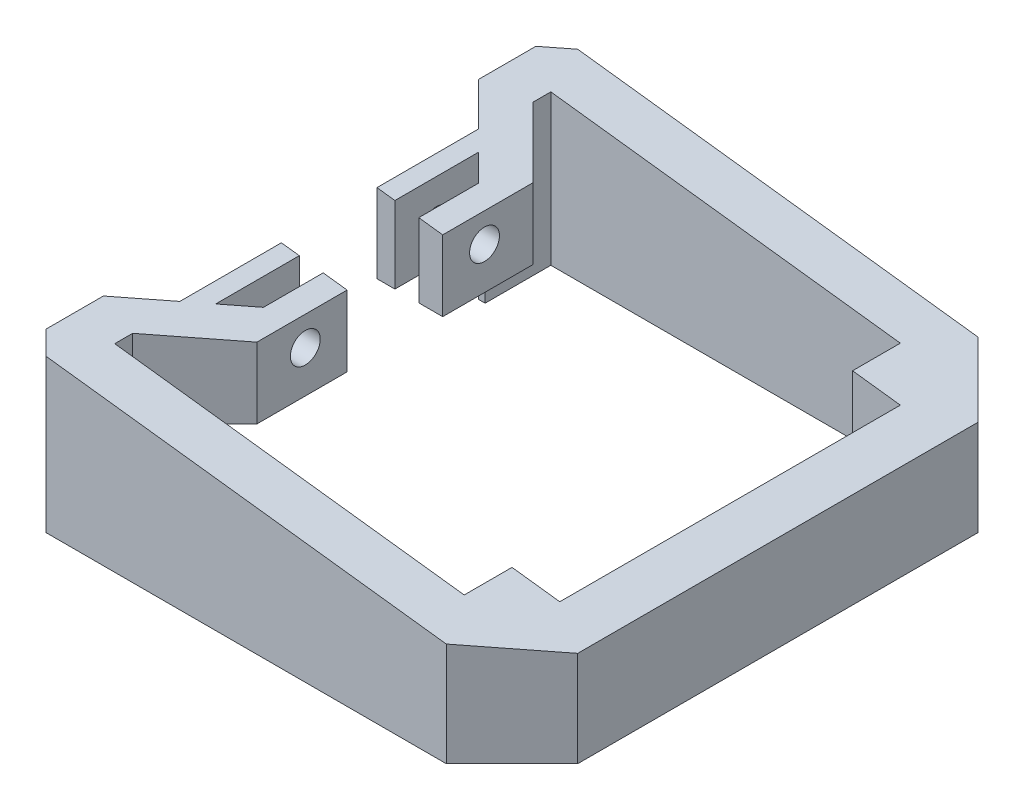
ISO-10303-21;
HEADER;
FILE_DESCRIPTION(('STEP AP214'),'2;1');
FILE_NAME('part.step','',(''),(''),'','','');
FILE_SCHEMA(('AUTOMOTIVE_DESIGN { 1 0 10303 214 1 1 1 1 }'));
ENDSEC;
DATA;
#1=APPLICATION_CONTEXT('core data for automotive mechanical design processes');
#2=APPLICATION_PROTOCOL_DEFINITION('international standard','automotive_design',2000,#1);
#3=PRODUCT_CONTEXT('',#1,'mechanical');
#4=PRODUCT('Part','Part','',(#3));
#5=PRODUCT_RELATED_PRODUCT_CATEGORY('part','',(#4));
#6=PRODUCT_DEFINITION_FORMATION('','',#4);
#7=PRODUCT_DEFINITION_CONTEXT('part definition',#1,'design');
#8=PRODUCT_DEFINITION('design','',#6,#7);
#9=PRODUCT_DEFINITION_SHAPE('','',#8);
#10=(LENGTH_UNIT() NAMED_UNIT(*) SI_UNIT(.MILLI.,.METRE.));
#11=(NAMED_UNIT(*) PLANE_ANGLE_UNIT() SI_UNIT($,.RADIAN.));
#12=(NAMED_UNIT(*) SI_UNIT($,.STERADIAN.) SOLID_ANGLE_UNIT());
#13=UNCERTAINTY_MEASURE_WITH_UNIT(LENGTH_MEASURE(1.E-05),#10,'distance_accuracy_value','');
#14=(GEOMETRIC_REPRESENTATION_CONTEXT(3) GLOBAL_UNCERTAINTY_ASSIGNED_CONTEXT((#13)) GLOBAL_UNIT_ASSIGNED_CONTEXT((#10,
#11,#12)) REPRESENTATION_CONTEXT('',''));
#15=CARTESIAN_POINT('',(0.,0.,0.));
#16=DIRECTION('',(0.,0.,1.));
#17=DIRECTION('',(1.,0.,0.));
#18=AXIS2_PLACEMENT_3D('',#15,#16,#17);
#19=CARTESIAN_POINT('',(1.45000000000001,6.,7.19999999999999));
#20=DIRECTION('',(1.,0.,0.));
#21=DIRECTION('',(0.,0.,-1.));
#22=AXIS2_PLACEMENT_3D('',#19,#20,#21);
#23=PLANE('',#22);
#24=CARTESIAN_POINT('',(1.45000000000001,9.5,9.25));
#25=DIRECTION('',(1.,0.,0.));
#26=DIRECTION('',(0.,0.,-1.));
#27=AXIS2_PLACEMENT_3D('',#24,#25,#26);
#28=CIRCLE('',#27,0.75);
#29=CARTESIAN_POINT('',(1.45000000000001,9.5,8.5));
#30=VERTEX_POINT('',#29);
#31=EDGE_CURVE('E644',#30,#30,#28,.T.);
#32=ORIENTED_EDGE('',*,*,#31,.T.);
#33=EDGE_LOOP('',(#32));
#34=FACE_BOUND('',#33,.T.);
#35=DIRECTION('',(0.,0.,1.));
#36=VECTOR('',#35,1.);
#37=CARTESIAN_POINT('',(1.45000000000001,6.,4.25));
#38=LINE('',#37,#36);
#39=CARTESIAN_POINT('',(1.45000000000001,6.,4.25));
#40=VERTEX_POINT('',#39);
#41=CARTESIAN_POINT('',(1.45000000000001,6.,12.75));
#42=VERTEX_POINT('',#41);
#43=EDGE_CURVE('E492',#40,#42,#38,.T.);
#44=ORIENTED_EDGE('',*,*,#43,.T.);
#45=DIRECTION('',(0.,-1.,0.));
#46=VECTOR('',#45,1.);
#47=CARTESIAN_POINT('',(1.45000000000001,6.,12.75));
#48=LINE('',#47,#46);
#49=CARTESIAN_POINT('',(1.45000000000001,12.6073619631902,12.75));
#50=VERTEX_POINT('',#49);
#51=EDGE_CURVE('E438',#50,#42,#48,.T.);
#52=ORIENTED_EDGE('',*,*,#51,.F.);
#53=DIRECTION('',(0.,0.,-1.));
#54=VECTOR('',#53,1.);
#55=CARTESIAN_POINT('',(1.45000000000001,12.6073619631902,7.19999999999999));
#56=LINE('',#55,#54);
#57=CARTESIAN_POINT('',(1.45000000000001,12.6073619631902,4.25));
#58=VERTEX_POINT('',#57);
#59=EDGE_CURVE('E768',#50,#58,#56,.T.);
#60=ORIENTED_EDGE('',*,*,#59,.T.);
#61=DIRECTION('',(0.,-1.,0.));
#62=VECTOR('',#61,1.);
#63=CARTESIAN_POINT('',(1.45000000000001,13.,4.25));
#64=LINE('',#63,#62);
#65=EDGE_CURVE('E504',#58,#40,#64,.T.);
#66=ORIENTED_EDGE('',*,*,#65,.T.);
#67=EDGE_LOOP('',(#44,#52,#60,#66));
#68=FACE_BOUND('',#67,.T.);
#69=ADVANCED_FACE('F39',(#34,#68),#23,.F.);
#70=CARTESIAN_POINT('',(1.45000000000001,9.5,24.25));
#71=DIRECTION('',(1.,0.,0.));
#72=DIRECTION('',(0.,0.,-1.));
#73=AXIS2_PLACEMENT_3D('',#70,#71,#72);
#74=CIRCLE('',#73,0.750000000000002);
#75=CARTESIAN_POINT('',(1.45000000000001,9.5,23.5));
#76=VERTEX_POINT('',#75);
#77=EDGE_CURVE('E409',#76,#76,#74,.T.);
#78=ORIENTED_EDGE('',*,*,#77,.T.);
#79=EDGE_LOOP('',(#78));
#80=FACE_BOUND('',#79,.T.);
#81=DIRECTION('',(0.,1.,0.));
#82=VECTOR('',#81,1.);
#83=CARTESIAN_POINT('',(1.45000000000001,6.,20.75));
#84=LINE('',#83,#82);
#85=CARTESIAN_POINT('',(1.45000000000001,6.,20.75));
#86=VERTEX_POINT('',#85);
#87=CARTESIAN_POINT('',(1.45000000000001,12.6073619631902,20.75));
#88=VERTEX_POINT('',#87);
#89=EDGE_CURVE('E428',#86,#88,#84,.T.);
#90=ORIENTED_EDGE('',*,*,#89,.F.);
#91=CARTESIAN_POINT('',(1.45000000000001,6.,29.25));
#92=VERTEX_POINT('',#91);
#93=EDGE_CURVE('E55',#86,#92,#38,.T.);
#94=ORIENTED_EDGE('',*,*,#93,.T.);
#95=DIRECTION('',(0.,-1.,0.));
#96=VECTOR('',#95,1.);
#97=CARTESIAN_POINT('',(1.45000000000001,13.,29.25));
#98=LINE('',#97,#96);
#99=CARTESIAN_POINT('',(1.45000000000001,12.6073619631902,29.25));
#100=VERTEX_POINT('',#99);
#101=EDGE_CURVE('E500',#100,#92,#98,.T.);
#102=ORIENTED_EDGE('',*,*,#101,.F.);
#103=DIRECTION('',(0.,0.,-1.));
#104=VECTOR('',#103,1.);
#105=CARTESIAN_POINT('',(1.45000000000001,12.6073619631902,7.19999999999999));
#106=LINE('',#105,#104);
#107=EDGE_CURVE('E681',#100,#88,#106,.T.);
#108=ORIENTED_EDGE('',*,*,#107,.T.);
#109=EDGE_LOOP('',(#90,#94,#102,#108));
#110=FACE_BOUND('',#109,.T.);
#111=ADVANCED_FACE('F811',(#80,#110),#23,.F.);
#112=CARTESIAN_POINT('',(6.95,6.,5.19999999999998));
#113=DIRECTION('',(1.,0.,0.));
#114=DIRECTION('',(0.,0.,-1.));
#115=AXIS2_PLACEMENT_3D('',#112,#113,#114);
#116=PLANE('',#115);
#117=CARTESIAN_POINT('',(6.95,9.5,9.25));
#118=DIRECTION('',(1.,0.,0.));
#119=DIRECTION('',(0.,0.,-1.));
#120=AXIS2_PLACEMENT_3D('',#117,#118,#119);
#121=CIRCLE('',#120,1.25);
#122=CARTESIAN_POINT('',(6.95,9.5,8.));
#123=VERTEX_POINT('',#122);
#124=EDGE_CURVE('E442',#123,#123,#121,.T.);
#125=ORIENTED_EDGE('',*,*,#124,.F.);
#126=EDGE_LOOP('',(#125));
#127=FACE_BOUND('',#126,.T.);
#128=DIRECTION('',(0.,-1.,0.));
#129=VECTOR('',#128,1.);
#130=CARTESIAN_POINT('',(6.95,13.,12.75));
#131=LINE('',#130,#129);
#132=CARTESIAN_POINT('',(6.95,11.9325153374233,12.75));
#133=VERTEX_POINT('',#132);
#134=CARTESIAN_POINT('',(6.95,6.,12.75));
#135=VERTEX_POINT('',#134);
#136=EDGE_CURVE('E400',#133,#135,#131,.T.);
#137=ORIENTED_EDGE('',*,*,#136,.T.);
#138=DIRECTION('',(0.,0.,-1.));
#139=VECTOR('',#138,1.);
#140=CARTESIAN_POINT('',(6.95,6.,28.3));
#141=LINE('',#140,#139);
#142=CARTESIAN_POINT('',(6.95,6.,5.19999999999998));
#143=VERTEX_POINT('',#142);
#144=EDGE_CURVE('E63',#135,#143,#141,.T.);
#145=ORIENTED_EDGE('',*,*,#144,.T.);
#146=DIRECTION('',(0.,-1.,0.));
#147=VECTOR('',#146,1.);
#148=CARTESIAN_POINT('',(6.95,6.,5.19999999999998));
#149=LINE('',#148,#147);
#150=CARTESIAN_POINT('',(6.95,11.9325153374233,5.19999999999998));
#151=VERTEX_POINT('',#150);
#152=EDGE_CURVE('E402',#151,#143,#149,.T.);
#153=ORIENTED_EDGE('',*,*,#152,.F.);
#154=DIRECTION('',(0.,0.,-1.));
#155=VECTOR('',#154,1.);
#156=CARTESIAN_POINT('',(6.95,11.9325153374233,5.19999999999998));
#157=LINE('',#156,#155);
#158=EDGE_CURVE('E389',#133,#151,#157,.T.);
#159=ORIENTED_EDGE('',*,*,#158,.F.);
#160=EDGE_LOOP('',(#137,#145,#153,#159));
#161=FACE_BOUND('',#160,.T.);
#162=ADVANCED_FACE('F399',(#127,#161),#116,.T.);
#163=CARTESIAN_POINT('',(6.95,9.5,24.25));
#164=DIRECTION('',(1.,0.,0.));
#165=DIRECTION('',(0.,0.,-1.));
#166=AXIS2_PLACEMENT_3D('',#163,#164,#165);
#167=CIRCLE('',#166,1.25);
#168=CARTESIAN_POINT('',(6.95,9.5,23.));
#169=VERTEX_POINT('',#168);
#170=EDGE_CURVE('E446',#169,#169,#167,.T.);
#171=ORIENTED_EDGE('',*,*,#170,.F.);
#172=EDGE_LOOP('',(#171));
#173=FACE_BOUND('',#172,.T.);
#174=DIRECTION('',(0.,-1.,0.));
#175=VECTOR('',#174,1.);
#176=CARTESIAN_POINT('',(6.95,6.,28.3));
#177=LINE('',#176,#175);
#178=CARTESIAN_POINT('',(6.95,11.9325153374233,28.3));
#179=VERTEX_POINT('',#178);
#180=CARTESIAN_POINT('',(6.95,6.,28.3));
#181=VERTEX_POINT('',#180);
#182=EDGE_CURVE('E583',#179,#181,#177,.T.);
#183=ORIENTED_EDGE('',*,*,#182,.T.);
#184=CARTESIAN_POINT('',(6.95,6.,20.75));
#185=VERTEX_POINT('',#184);
#186=EDGE_CURVE('E963',#181,#185,#141,.T.);
#187=ORIENTED_EDGE('',*,*,#186,.T.);
#188=DIRECTION('',(0.,1.,0.));
#189=VECTOR('',#188,1.);
#190=CARTESIAN_POINT('',(6.95,13.,20.75));
#191=LINE('',#190,#189);
#192=CARTESIAN_POINT('',(6.95,11.9325153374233,20.75));
#193=VERTEX_POINT('',#192);
#194=EDGE_CURVE('E408',#185,#193,#191,.T.);
#195=ORIENTED_EDGE('',*,*,#194,.T.);
#196=DIRECTION('',(0.,0.,-1.));
#197=VECTOR('',#196,1.);
#198=CARTESIAN_POINT('',(6.95,11.9325153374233,5.19999999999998));
#199=LINE('',#198,#197);
#200=EDGE_CURVE('E764',#179,#193,#199,.T.);
#201=ORIENTED_EDGE('',*,*,#200,.F.);
#202=EDGE_LOOP('',(#183,#187,#195,#201));
#203=FACE_BOUND('',#202,.T.);
#204=ADVANCED_FACE('F1166',(#173,#203),#116,.T.);
#205=CARTESIAN_POINT('',(2.95000000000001,6.,8.69999999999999));
#206=DIRECTION('',(1.,0.,0.));
#207=DIRECTION('',(0.,0.,-1.));
#208=AXIS2_PLACEMENT_3D('',#205,#206,#207);
#209=PLANE('',#208);
#210=CARTESIAN_POINT('',(2.95000000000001,9.5,9.25));
#211=DIRECTION('',(1.,0.,0.));
#212=DIRECTION('',(0.,0.,-1.));
#213=AXIS2_PLACEMENT_3D('',#210,#211,#212);
#214=CIRCLE('',#213,0.75);
#215=CARTESIAN_POINT('',(2.95000000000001,9.5,8.5));
#216=VERTEX_POINT('',#215);
#217=EDGE_CURVE('E633',#216,#216,#214,.T.);
#218=ORIENTED_EDGE('',*,*,#217,.F.);
#219=EDGE_LOOP('',(#218));
#220=FACE_BOUND('',#219,.T.);
#221=DIRECTION('',(0.,-1.,0.));
#222=VECTOR('',#221,1.);
#223=CARTESIAN_POINT('',(2.95000000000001,6.,12.75));
#224=LINE('',#223,#222);
#225=CARTESIAN_POINT('',(2.95000000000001,12.4233128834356,12.75));
#226=VERTEX_POINT('',#225);
#227=CARTESIAN_POINT('',(2.95000000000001,6.,12.75));
#228=VERTEX_POINT('',#227);
#229=EDGE_CURVE('E434',#226,#228,#224,.T.);
#230=ORIENTED_EDGE('',*,*,#229,.T.);
#231=DIRECTION('',(0.,0.,1.));
#232=VECTOR('',#231,1.);
#233=CARTESIAN_POINT('',(2.95000000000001,6.,5.75));
#234=LINE('',#233,#232);
#235=CARTESIAN_POINT('',(2.95000000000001,6.,5.75));
#236=VERTEX_POINT('',#235);
#237=EDGE_CURVE('E461',#236,#228,#234,.T.);
#238=ORIENTED_EDGE('',*,*,#237,.F.);
#239=DIRECTION('',(0.,-1.,0.));
#240=VECTOR('',#239,1.);
#241=CARTESIAN_POINT('',(2.95000000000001,13.,5.75));
#242=LINE('',#241,#240);
#243=CARTESIAN_POINT('',(2.95000000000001,12.4233128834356,5.75));
#244=VERTEX_POINT('',#243);
#245=EDGE_CURVE('E482',#244,#236,#242,.T.);
#246=ORIENTED_EDGE('',*,*,#245,.F.);
#247=DIRECTION('',(0.,0.,-1.));
#248=VECTOR('',#247,1.);
#249=CARTESIAN_POINT('',(2.95000000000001,12.4233128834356,8.69999999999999));
#250=LINE('',#249,#248);
#251=EDGE_CURVE('E734',#226,#244,#250,.T.);
#252=ORIENTED_EDGE('',*,*,#251,.F.);
#253=EDGE_LOOP('',(#230,#238,#246,#252));
#254=FACE_BOUND('',#253,.T.);
#255=ADVANCED_FACE('F659',(#220,#254),#209,.T.);
#256=CARTESIAN_POINT('',(2.95000000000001,9.5,24.25));
#257=DIRECTION('',(1.,0.,0.));
#258=DIRECTION('',(0.,0.,-1.));
#259=AXIS2_PLACEMENT_3D('',#256,#257,#258);
#260=CIRCLE('',#259,0.750000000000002);
#261=CARTESIAN_POINT('',(2.95000000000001,9.5,23.5));
#262=VERTEX_POINT('',#261);
#263=EDGE_CURVE('E418',#262,#262,#260,.T.);
#264=ORIENTED_EDGE('',*,*,#263,.F.);
#265=EDGE_LOOP('',(#264));
#266=FACE_BOUND('',#265,.T.);
#267=CARTESIAN_POINT('',(2.95000000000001,6.,20.75));
#268=VERTEX_POINT('',#267);
#269=CARTESIAN_POINT('',(2.95000000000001,6.,27.75));
#270=VERTEX_POINT('',#269);
#271=EDGE_CURVE('E460',#268,#270,#234,.T.);
#272=ORIENTED_EDGE('',*,*,#271,.F.);
#273=DIRECTION('',(0.,1.,0.));
#274=VECTOR('',#273,1.);
#275=CARTESIAN_POINT('',(2.95000000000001,6.,20.75));
#276=LINE('',#275,#274);
#277=CARTESIAN_POINT('',(2.95000000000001,12.4233128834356,20.75));
#278=VERTEX_POINT('',#277);
#279=EDGE_CURVE('E425',#268,#278,#276,.T.);
#280=ORIENTED_EDGE('',*,*,#279,.T.);
#281=DIRECTION('',(0.,0.,-1.));
#282=VECTOR('',#281,1.);
#283=CARTESIAN_POINT('',(2.95000000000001,12.4233128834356,8.69999999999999));
#284=LINE('',#283,#282);
#285=CARTESIAN_POINT('',(2.95000000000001,12.4233128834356,27.75));
#286=VERTEX_POINT('',#285);
#287=EDGE_CURVE('E682',#286,#278,#284,.T.);
#288=ORIENTED_EDGE('',*,*,#287,.F.);
#289=DIRECTION('',(0.,-1.,0.));
#290=VECTOR('',#289,1.);
#291=CARTESIAN_POINT('',(2.95000000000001,13.,27.75));
#292=LINE('',#291,#290);
#293=EDGE_CURVE('E479',#286,#270,#292,.T.);
#294=ORIENTED_EDGE('',*,*,#293,.T.);
#295=EDGE_LOOP('',(#272,#280,#288,#294));
#296=FACE_BOUND('',#295,.T.);
#297=ADVANCED_FACE('F655',(#266,#296),#209,.T.);
#298=CARTESIAN_POINT('',(4.95,6.,22.8));
#299=DIRECTION('',(-1.,0.,0.));
#300=DIRECTION('',(0.,0.,1.));
#301=AXIS2_PLACEMENT_3D('',#298,#299,#300);
#302=PLANE('',#301);
#303=CARTESIAN_POINT('',(4.95,9.5,9.25));
#304=DIRECTION('',(1.,0.,0.));
#305=DIRECTION('',(0.,0.,-1.));
#306=AXIS2_PLACEMENT_3D('',#303,#304,#305);
#307=CIRCLE('',#306,1.25);
#308=CARTESIAN_POINT('',(4.95,9.5,8.));
#309=VERTEX_POINT('',#308);
#310=EDGE_CURVE('E443',#309,#309,#307,.T.);
#311=ORIENTED_EDGE('',*,*,#310,.T.);
#312=EDGE_LOOP('',(#311));
#313=FACE_BOUND('',#312,.T.);
#314=DIRECTION('',(0.,0.,-1.));
#315=VECTOR('',#314,1.);
#316=CARTESIAN_POINT('',(4.95000000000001,6.,7.75));
#317=LINE('',#316,#315);
#318=CARTESIAN_POINT('',(4.95,6.,12.75));
#319=VERTEX_POINT('',#318);
#320=CARTESIAN_POINT('',(4.95,6.,7.75));
#321=VERTEX_POINT('',#320);
#322=EDGE_CURVE('E467',#319,#321,#317,.T.);
#323=ORIENTED_EDGE('',*,*,#322,.F.);
#324=DIRECTION('',(0.,1.,0.));
#325=VECTOR('',#324,1.);
#326=CARTESIAN_POINT('',(4.95,6.,12.75));
#327=LINE('',#326,#325);
#328=CARTESIAN_POINT('',(4.95000000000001,12.1779141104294,12.75));
#329=VERTEX_POINT('',#328);
#330=EDGE_CURVE('E431',#319,#329,#327,.T.);
#331=ORIENTED_EDGE('',*,*,#330,.T.);
#332=DIRECTION('',(0.,0.,1.));
#333=VECTOR('',#332,1.);
#334=CARTESIAN_POINT('',(4.95,12.1779141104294,22.8));
#335=LINE('',#334,#333);
#336=CARTESIAN_POINT('',(4.95,12.1779141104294,7.75));
#337=VERTEX_POINT('',#336);
#338=EDGE_CURVE('E392',#337,#329,#335,.T.);
#339=ORIENTED_EDGE('',*,*,#338,.F.);
#340=DIRECTION('',(0.,-1.,0.));
#341=VECTOR('',#340,1.);
#342=CARTESIAN_POINT('',(4.95000000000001,13.,7.75));
#343=LINE('',#342,#341);
#344=EDGE_CURVE('E471',#337,#321,#343,.T.);
#345=ORIENTED_EDGE('',*,*,#344,.T.);
#346=EDGE_LOOP('',(#323,#331,#339,#345));
#347=FACE_BOUND('',#346,.T.);
#348=ADVANCED_FACE('F658',(#313,#347),#302,.T.);
#349=CARTESIAN_POINT('',(4.95,9.5,24.25));
#350=DIRECTION('',(1.,0.,0.));
#351=DIRECTION('',(0.,0.,-1.));
#352=AXIS2_PLACEMENT_3D('',#349,#350,#351);
#353=CIRCLE('',#352,1.25);
#354=CARTESIAN_POINT('',(4.95,9.5,23.));
#355=VERTEX_POINT('',#354);
#356=EDGE_CURVE('E450',#355,#355,#353,.T.);
#357=ORIENTED_EDGE('',*,*,#356,.T.);
#358=EDGE_LOOP('',(#357));
#359=FACE_BOUND('',#358,.T.);
#360=DIRECTION('',(0.,-1.,0.));
#361=VECTOR('',#360,1.);
#362=CARTESIAN_POINT('',(4.95,6.,20.75));
#363=LINE('',#362,#361);
#364=CARTESIAN_POINT('',(4.95,12.1779141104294,20.75));
#365=VERTEX_POINT('',#364);
#366=CARTESIAN_POINT('',(4.95,6.,20.75));
#367=VERTEX_POINT('',#366);
#368=EDGE_CURVE('E414',#365,#367,#363,.T.);
#369=ORIENTED_EDGE('',*,*,#368,.T.);
#370=CARTESIAN_POINT('',(4.95000000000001,6.,25.75));
#371=VERTEX_POINT('',#370);
#372=EDGE_CURVE('E468',#371,#367,#317,.T.);
#373=ORIENTED_EDGE('',*,*,#372,.F.);
#374=DIRECTION('',(0.,-1.,0.));
#375=VECTOR('',#374,1.);
#376=CARTESIAN_POINT('',(4.95000000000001,13.,25.75));
#377=LINE('',#376,#375);
#378=CARTESIAN_POINT('',(4.95,12.1779141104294,25.75));
#379=VERTEX_POINT('',#378);
#380=EDGE_CURVE('E475',#379,#371,#377,.T.);
#381=ORIENTED_EDGE('',*,*,#380,.F.);
#382=DIRECTION('',(0.,0.,1.));
#383=VECTOR('',#382,1.);
#384=CARTESIAN_POINT('',(4.95,12.1779141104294,22.8));
#385=LINE('',#384,#383);
#386=EDGE_CURVE('E777',#365,#379,#385,.T.);
#387=ORIENTED_EDGE('',*,*,#386,.F.);
#388=EDGE_LOOP('',(#369,#373,#381,#387));
#389=FACE_BOUND('',#388,.T.);
#390=ADVANCED_FACE('F796',(#359,#389),#302,.T.);
#391=CARTESIAN_POINT('',(1.75,6.,0.));
#392=DIRECTION('',(0.707106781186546,0.,-0.707106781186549));
#393=DIRECTION('',(-0.707106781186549,0.,-0.707106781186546));
#394=AXIS2_PLACEMENT_3D('',#391,#392,#393);
#395=PLANE('',#394);
#396=ORIENTED_EDGE('',*,*,#152,.T.);
#397=DIRECTION('',(-0.707106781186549,0.,-0.707106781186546));
#398=VECTOR('',#397,1.);
#399=CARTESIAN_POINT('',(6.95,6.,5.19999999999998));
#400=LINE('',#399,#398);
#401=CARTESIAN_POINT('',(1.75,6.,0.));
#402=VERTEX_POINT('',#401);
#403=EDGE_CURVE('E966',#143,#402,#400,.T.);
#404=ORIENTED_EDGE('',*,*,#403,.T.);
#405=DIRECTION('',(0.,-1.,0.));
#406=VECTOR('',#405,1.);
#407=CARTESIAN_POINT('',(1.75,6.,0.));
#408=LINE('',#407,#406);
#409=CARTESIAN_POINT('',(1.75,12.5705521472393,0.));
#410=VERTEX_POINT('',#409);
#411=EDGE_CURVE('E589',#410,#402,#408,.T.);
#412=ORIENTED_EDGE('',*,*,#411,.F.);
#413=DIRECTION('',(-0.704460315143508,0.086436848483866,-0.704460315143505));
#414=VECTOR('',#413,1.);
#415=CARTESIAN_POINT('',(2.15008965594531,12.5214613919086,0.40008965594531));
#416=LINE('',#415,#414);
#417=EDGE_CURVE('E725',#151,#410,#416,.T.);
#418=ORIENTED_EDGE('',*,*,#417,.F.);
#419=EDGE_LOOP('',(#396,#404,#412,#418));
#420=FACE_BOUND('',#419,.T.);
#421=ADVANCED_FACE('F798',(#420),#395,.T.);
#422=CARTESIAN_POINT('',(1.75,6.,33.5));
#423=DIRECTION('',(0.707106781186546,0.,0.707106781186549));
#424=DIRECTION('',(0.707106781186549,0.,-0.707106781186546));
#425=AXIS2_PLACEMENT_3D('',#422,#423,#424);
#426=PLANE('',#425);
#427=DIRECTION('',(0.,-1.,0.));
#428=VECTOR('',#427,1.);
#429=CARTESIAN_POINT('',(1.75,6.,33.5));
#430=LINE('',#429,#428);
#431=CARTESIAN_POINT('',(1.75,12.5705521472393,33.5));
#432=VERTEX_POINT('',#431);
#433=CARTESIAN_POINT('',(1.75,6.,33.5));
#434=VERTEX_POINT('',#433);
#435=EDGE_CURVE('E579',#432,#434,#430,.T.);
#436=ORIENTED_EDGE('',*,*,#435,.T.);
#437=DIRECTION('',(0.707106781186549,0.,-0.707106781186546));
#438=VECTOR('',#437,1.);
#439=CARTESIAN_POINT('',(1.75,6.,33.5));
#440=LINE('',#439,#438);
#441=EDGE_CURVE('E959',#434,#181,#440,.T.);
#442=ORIENTED_EDGE('',*,*,#441,.T.);
#443=ORIENTED_EDGE('',*,*,#182,.F.);
#444=DIRECTION('',(0.704460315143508,-0.086436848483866,-0.704460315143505));
#445=VECTOR('',#444,1.);
#446=CARTESIAN_POINT('',(2.15008965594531,12.5214613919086,33.0999103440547));
#447=LINE('',#446,#445);
#448=EDGE_CURVE('E761',#432,#179,#447,.T.);
#449=ORIENTED_EDGE('',*,*,#448,.F.);
#450=EDGE_LOOP('',(#436,#442,#443,#449));
#451=FACE_BOUND('',#450,.T.);
#452=ADVANCED_FACE('F805',(#451),#426,.T.);
#453=CARTESIAN_POINT('',(-1.05,13.,20.75));
#454=DIRECTION('',(0.,0.,-1.));
#455=DIRECTION('',(0.,1.,0.));
#456=AXIS2_PLACEMENT_3D('',#453,#454,#455);
#457=PLANE('',#456);
#458=ORIENTED_EDGE('',*,*,#194,.F.);
#459=DIRECTION('',(-1.,0.,0.));
#460=VECTOR('',#459,1.);
#461=CARTESIAN_POINT('',(-1.05,6.,20.75));
#462=LINE('',#461,#460);
#463=EDGE_CURVE('E672',#185,#367,#462,.T.);
#464=ORIENTED_EDGE('',*,*,#463,.T.);
#465=ORIENTED_EDGE('',*,*,#368,.F.);
#466=DIRECTION('',(-0.992556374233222,0.121786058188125,0.));
#467=VECTOR('',#466,1.);
#468=CARTESIAN_POINT('',(-1.0603822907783,12.9153843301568,20.75));
#469=LINE('',#468,#467);
#470=EDGE_CURVE('E772',#193,#365,#469,.T.);
#471=ORIENTED_EDGE('',*,*,#470,.F.);
#472=EDGE_LOOP('',(#458,#464,#465,#471));
#473=FACE_BOUND('',#472,.T.);
#474=ADVANCED_FACE('F791',(#473),#457,.T.);
#475=ORIENTED_EDGE('',*,*,#279,.F.);
#476=DIRECTION('',(-1.,0.,0.));
#477=VECTOR('',#476,1.);
#478=CARTESIAN_POINT('',(-1.05,6.,20.75));
#479=LINE('',#478,#477);
#480=EDGE_CURVE('E667',#268,#86,#479,.T.);
#481=ORIENTED_EDGE('',*,*,#480,.T.);
#482=ORIENTED_EDGE('',*,*,#89,.T.);
#483=DIRECTION('',(-0.992556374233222,0.121786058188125,0.));
#484=VECTOR('',#483,1.);
#485=CARTESIAN_POINT('',(-1.0603822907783,12.9153843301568,20.75));
#486=LINE('',#485,#484);
#487=EDGE_CURVE('E678',#278,#88,#486,.T.);
#488=ORIENTED_EDGE('',*,*,#487,.F.);
#489=EDGE_LOOP('',(#475,#481,#482,#488));
#490=FACE_BOUND('',#489,.T.);
#491=ADVANCED_FACE('F676',(#490),#457,.T.);
#492=CARTESIAN_POINT('',(-1.05,13.,12.75));
#493=DIRECTION('',(0.,0.,1.));
#494=DIRECTION('',(0.,-1.,0.));
#495=AXIS2_PLACEMENT_3D('',#492,#493,#494);
#496=PLANE('',#495);
#497=ORIENTED_EDGE('',*,*,#51,.T.);
#498=DIRECTION('',(1.,0.,0.));
#499=VECTOR('',#498,1.);
#500=CARTESIAN_POINT('',(-1.05,6.,12.75));
#501=LINE('',#500,#499);
#502=EDGE_CURVE('E673',#42,#228,#501,.T.);
#503=ORIENTED_EDGE('',*,*,#502,.T.);
#504=ORIENTED_EDGE('',*,*,#229,.F.);
#505=DIRECTION('',(0.992556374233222,-0.121786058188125,0.));
#506=VECTOR('',#505,1.);
#507=CARTESIAN_POINT('',(-1.0603822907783,12.9153843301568,12.75));
#508=LINE('',#507,#506);
#509=EDGE_CURVE('E737',#50,#226,#508,.T.);
#510=ORIENTED_EDGE('',*,*,#509,.F.);
#511=EDGE_LOOP('',(#497,#503,#504,#510));
#512=FACE_BOUND('',#511,.T.);
#513=ADVANCED_FACE('F838',(#512),#496,.T.);
#514=ORIENTED_EDGE('',*,*,#330,.F.);
#515=DIRECTION('',(1.,0.,0.));
#516=VECTOR('',#515,1.);
#517=CARTESIAN_POINT('',(-1.05,6.,12.75));
#518=LINE('',#517,#516);
#519=EDGE_CURVE('E12',#319,#135,#518,.T.);
#520=ORIENTED_EDGE('',*,*,#519,.T.);
#521=ORIENTED_EDGE('',*,*,#136,.F.);
#522=DIRECTION('',(0.992556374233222,-0.121786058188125,0.));
#523=VECTOR('',#522,1.);
#524=CARTESIAN_POINT('',(-1.0603822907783,12.9153843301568,12.75));
#525=LINE('',#524,#523);
#526=EDGE_CURVE('E48',#329,#133,#525,.T.);
#527=ORIENTED_EDGE('',*,*,#526,.F.);
#528=EDGE_LOOP('',(#514,#520,#521,#527));
#529=FACE_BOUND('',#528,.T.);
#530=ADVANCED_FACE('F406',(#529),#496,.T.);
#531=CARTESIAN_POINT('',(0.,0.,0.));
#532=DIRECTION('',(0.,-1.,0.));
#533=DIRECTION('',(0.,0.,-1.));
#534=AXIS2_PLACEMENT_3D('',#531,#532,#533);
#535=PLANE('',#534);
#536=DIRECTION('',(-0.707106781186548,0.,0.707106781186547));
#537=VECTOR('',#536,1.);
#538=CARTESIAN_POINT('',(-1.75,0.,32.45));
#539=LINE('',#538,#537);
#540=CARTESIAN_POINT('',(1.20000000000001,0.,29.5));
#541=VERTEX_POINT('',#540);
#542=CARTESIAN_POINT('',(-1.75,0.,32.45));
#543=VERTEX_POINT('',#542);
#544=EDGE_CURVE('E860',#541,#543,#539,.T.);
#545=ORIENTED_EDGE('',*,*,#544,.F.);
#546=DIRECTION('',(-1.,0.,0.));
#547=VECTOR('',#546,1.);
#548=CARTESIAN_POINT('',(1.20000000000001,0.,29.5));
#549=LINE('',#548,#547);
#550=CARTESIAN_POINT('',(1.75,0.,29.5));
#551=VERTEX_POINT('',#550);
#552=EDGE_CURVE('E870',#551,#541,#549,.T.);
#553=ORIENTED_EDGE('',*,*,#552,.F.);
#554=DIRECTION('',(0.,0.,1.));
#555=VECTOR('',#554,1.);
#556=CARTESIAN_POINT('',(1.75,0.,35.));
#557=LINE('',#556,#555);
#558=CARTESIAN_POINT('',(1.75,0.,35.));
#559=VERTEX_POINT('',#558);
#560=EDGE_CURVE('E530',#551,#559,#557,.T.);
#561=ORIENTED_EDGE('',*,*,#560,.T.);
#562=DIRECTION('',(1.,0.,0.));
#563=VECTOR('',#562,1.);
#564=CARTESIAN_POINT('',(31.,0.,35.));
#565=LINE('',#564,#563);
#566=CARTESIAN_POINT('',(31.,0.,35.));
#567=VERTEX_POINT('',#566);
#568=EDGE_CURVE('E534',#559,#567,#565,.T.);
#569=ORIENTED_EDGE('',*,*,#568,.T.);
#570=DIRECTION('',(0.,0.,-1.));
#571=VECTOR('',#570,1.);
#572=CARTESIAN_POINT('',(31.,0.,31.));
#573=LINE('',#572,#571);
#574=CARTESIAN_POINT('',(31.,0.,31.));
#575=VERTEX_POINT('',#574);
#576=EDGE_CURVE('E538',#567,#575,#573,.T.);
#577=ORIENTED_EDGE('',*,*,#576,.T.);
#578=DIRECTION('',(1.,0.,0.));
#579=VECTOR('',#578,1.);
#580=CARTESIAN_POINT('',(35.,0.,31.));
#581=LINE('',#580,#579);
#582=CARTESIAN_POINT('',(35.,0.,31.));
#583=VERTEX_POINT('',#582);
#584=EDGE_CURVE('E542',#575,#583,#581,.T.);
#585=ORIENTED_EDGE('',*,*,#584,.T.);
#586=DIRECTION('',(0.,0.,-1.));
#587=VECTOR('',#586,1.);
#588=CARTESIAN_POINT('',(35.,0.,2.5));
#589=LINE('',#588,#587);
#590=CARTESIAN_POINT('',(35.,0.,2.5));
#591=VERTEX_POINT('',#590);
#592=EDGE_CURVE('E546',#583,#591,#589,.T.);
#593=ORIENTED_EDGE('',*,*,#592,.T.);
#594=DIRECTION('',(-1.,0.,0.));
#595=VECTOR('',#594,1.);
#596=CARTESIAN_POINT('',(31.,0.,2.5));
#597=LINE('',#596,#595);
#598=CARTESIAN_POINT('',(31.,0.,2.5));
#599=VERTEX_POINT('',#598);
#600=EDGE_CURVE('E550',#591,#599,#597,.T.);
#601=ORIENTED_EDGE('',*,*,#600,.T.);
#602=DIRECTION('',(0.,0.,-1.));
#603=VECTOR('',#602,1.);
#604=CARTESIAN_POINT('',(31.,0.,-1.5));
#605=LINE('',#604,#603);
#606=CARTESIAN_POINT('',(31.,0.,-1.5));
#607=VERTEX_POINT('',#606);
#608=EDGE_CURVE('E554',#599,#607,#605,.T.);
#609=ORIENTED_EDGE('',*,*,#608,.T.);
#610=DIRECTION('',(-1.,0.,0.));
#611=VECTOR('',#610,1.);
#612=CARTESIAN_POINT('',(1.75,0.,-1.5));
#613=LINE('',#612,#611);
#614=CARTESIAN_POINT('',(1.75,0.,-1.5));
#615=VERTEX_POINT('',#614);
#616=EDGE_CURVE('E524',#607,#615,#613,.T.);
#617=ORIENTED_EDGE('',*,*,#616,.T.);
#618=DIRECTION('',(0.,0.,1.));
#619=VECTOR('',#618,1.);
#620=CARTESIAN_POINT('',(1.75,0.,-1.5));
#621=LINE('',#620,#619);
#622=CARTESIAN_POINT('',(1.75,0.,3.99999999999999));
#623=VERTEX_POINT('',#622);
#624=EDGE_CURVE('E527',#615,#623,#621,.T.);
#625=ORIENTED_EDGE('',*,*,#624,.T.);
#626=DIRECTION('',(1.,0.,0.));
#627=VECTOR('',#626,1.);
#628=CARTESIAN_POINT('',(1.2,0.,3.99999999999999));
#629=LINE('',#628,#627);
#630=CARTESIAN_POINT('',(1.2,0.,3.99999999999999));
#631=VERTEX_POINT('',#630);
#632=EDGE_CURVE('E322',#631,#623,#629,.T.);
#633=ORIENTED_EDGE('',*,*,#632,.F.);
#634=DIRECTION('',(0.707106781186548,0.,0.707106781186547));
#635=VECTOR('',#634,1.);
#636=CARTESIAN_POINT('',(-1.75,0.,1.05));
#637=LINE('',#636,#635);
#638=CARTESIAN_POINT('',(-1.75,0.,1.05));
#639=VERTEX_POINT('',#638);
#640=EDGE_CURVE('E304',#639,#631,#637,.T.);
#641=ORIENTED_EDGE('',*,*,#640,.F.);
#642=DIRECTION('',(0.,0.,1.));
#643=VECTOR('',#642,1.);
#644=CARTESIAN_POINT('',(-1.75,0.,-3.75));
#645=LINE('',#644,#643);
#646=CARTESIAN_POINT('',(-1.75,0.,-3.75));
#647=VERTEX_POINT('',#646);
#648=EDGE_CURVE('E320',#647,#639,#645,.T.);
#649=ORIENTED_EDGE('',*,*,#648,.F.);
#650=DIRECTION('',(-0.707106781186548,0.,0.707106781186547));
#651=VECTOR('',#650,1.);
#652=CARTESIAN_POINT('',(-1.75,0.,-3.75));
#653=LINE('',#652,#651);
#654=CARTESIAN_POINT('',(0.,0.,-5.5));
#655=VERTEX_POINT('',#654);
#656=EDGE_CURVE('E331',#655,#647,#653,.T.);
#657=ORIENTED_EDGE('',*,*,#656,.F.);
#658=DIRECTION('',(-1.,0.,0.));
#659=VECTOR('',#658,1.);
#660=CARTESIAN_POINT('',(0.,0.,-5.5));
#661=LINE('',#660,#659);
#662=CARTESIAN_POINT('',(33.5,0.,-5.5));
#663=VERTEX_POINT('',#662);
#664=EDGE_CURVE('E339',#663,#655,#661,.T.);
#665=ORIENTED_EDGE('',*,*,#664,.F.);
#666=DIRECTION('',(-0.707106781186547,0.,-0.707106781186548));
#667=VECTOR('',#666,1.);
#668=CARTESIAN_POINT('',(33.5,0.,-5.5));
#669=LINE('',#668,#667);
#670=CARTESIAN_POINT('',(39.,0.,0.));
#671=VERTEX_POINT('',#670);
#672=EDGE_CURVE('E610',#671,#663,#669,.T.);
#673=ORIENTED_EDGE('',*,*,#672,.F.);
#674=DIRECTION('',(0.,0.,-1.));
#675=VECTOR('',#674,1.);
#676=CARTESIAN_POINT('',(39.,0.,0.));
#677=LINE('',#676,#675);
#678=CARTESIAN_POINT('',(39.,0.,33.5));
#679=VERTEX_POINT('',#678);
#680=EDGE_CURVE('E354',#679,#671,#677,.T.);
#681=ORIENTED_EDGE('',*,*,#680,.F.);
#682=DIRECTION('',(0.707106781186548,0.,-0.707106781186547));
#683=VECTOR('',#682,1.);
#684=CARTESIAN_POINT('',(39.,0.,33.5));
#685=LINE('',#684,#683);
#686=CARTESIAN_POINT('',(33.5,0.,39.));
#687=VERTEX_POINT('',#686);
#688=EDGE_CURVE('E350',#687,#679,#685,.T.);
#689=ORIENTED_EDGE('',*,*,#688,.F.);
#690=DIRECTION('',(1.,0.,0.));
#691=VECTOR('',#690,1.);
#692=CARTESIAN_POINT('',(33.5,0.,39.));
#693=LINE('',#692,#691);
#694=CARTESIAN_POINT('',(0.,0.,39.));
#695=VERTEX_POINT('',#694);
#696=EDGE_CURVE('E346',#695,#687,#693,.T.);
#697=ORIENTED_EDGE('',*,*,#696,.F.);
#698=DIRECTION('',(0.70710678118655,0.,0.707106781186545));
#699=VECTOR('',#698,1.);
#700=CARTESIAN_POINT('',(0.,0.,39.));
#701=LINE('',#700,#699);
#702=CARTESIAN_POINT('',(-1.75,0.,37.25));
#703=VERTEX_POINT('',#702);
#704=EDGE_CURVE('E336',#703,#695,#701,.T.);
#705=ORIENTED_EDGE('',*,*,#704,.F.);
#706=DIRECTION('',(0.,0.,1.));
#707=VECTOR('',#706,1.);
#708=CARTESIAN_POINT('',(-1.75,0.,29.5));
#709=LINE('',#708,#707);
#710=EDGE_CURVE('E330',#543,#703,#709,.T.);
#711=ORIENTED_EDGE('',*,*,#710,.F.);
#712=EDGE_LOOP('',(#545,#553,#561,#569,#577,#585,#593,#601,#609,#617,#625,#633,#641,#649,#657,
#665,#673,#681,#689,#697,#705,#711));
#713=FACE_BOUND('',#712,.T.);
#714=CARTESIAN_POINT('',(0.,0.,33.5));
#715=DIRECTION('',(0.,1.,0.));
#716=DIRECTION('',(0.,0.,1.));
#717=AXIS2_PLACEMENT_3D('',#714,#715,#716);
#718=CIRCLE('',#717,1.1);
#719=CARTESIAN_POINT('',(0.,0.,34.6));
#720=VERTEX_POINT('',#719);
#721=EDGE_CURVE('E600',#720,#720,#718,.T.);
#722=ORIENTED_EDGE('',*,*,#721,.T.);
#723=EDGE_LOOP('',(#722));
#724=FACE_BOUND('',#723,.T.);
#725=CARTESIAN_POINT('',(0.,0.,0.));
#726=DIRECTION('',(0.,1.,0.));
#727=DIRECTION('',(0.,0.,1.));
#728=AXIS2_PLACEMENT_3D('',#725,#726,#727);
#729=CIRCLE('',#728,1.1);
#730=CARTESIAN_POINT('',(0.,0.,1.1));
#731=VERTEX_POINT('',#730);
#732=EDGE_CURVE('E607',#731,#731,#729,.T.);
#733=ORIENTED_EDGE('',*,*,#732,.T.);
#734=EDGE_LOOP('',(#733));
#735=FACE_BOUND('',#734,.T.);
#736=CARTESIAN_POINT('',(33.5,0.,0.));
#737=DIRECTION('',(0.,1.,0.));
#738=DIRECTION('',(0.,0.,1.));
#739=AXIS2_PLACEMENT_3D('',#736,#737,#738);
#740=CIRCLE('',#739,1.1);
#741=CARTESIAN_POINT('',(33.5,0.,1.1));
#742=VERTEX_POINT('',#741);
#743=EDGE_CURVE('E604',#742,#742,#740,.T.);
#744=ORIENTED_EDGE('',*,*,#743,.T.);
#745=EDGE_LOOP('',(#744));
#746=FACE_BOUND('',#745,.T.);
#747=CARTESIAN_POINT('',(33.5,0.,33.5));
#748=DIRECTION('',(0.,1.,0.));
#749=DIRECTION('',(0.,0.,1.));
#750=AXIS2_PLACEMENT_3D('',#747,#748,#749);
#751=CIRCLE('',#750,1.1);
#752=CARTESIAN_POINT('',(33.5,0.,34.6));
#753=VERTEX_POINT('',#752);
#754=EDGE_CURVE('E596',#753,#753,#751,.T.);
#755=ORIENTED_EDGE('',*,*,#754,.T.);
#756=EDGE_LOOP('',(#755));
#757=FACE_BOUND('',#756,.T.);
#758=ADVANCED_FACE('F317',(#713,#724,#735,#746,#757),#535,.T.);
#759=CARTESIAN_POINT('',(33.5,6.,-5.5));
#760=DIRECTION('',(-0.707106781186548,0.,0.707106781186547));
#761=DIRECTION('',(0.707106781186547,0.,0.707106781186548));
#762=AXIS2_PLACEMENT_3D('',#759,#760,#761);
#763=PLANE('',#762);
#764=DIRECTION('',(0.,-1.,0.));
#765=VECTOR('',#764,1.);
#766=CARTESIAN_POINT('',(33.5,6.,-5.5));
#767=LINE('',#766,#765);
#768=CARTESIAN_POINT('',(33.5,8.67484662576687,-5.5));
#769=VERTEX_POINT('',#768);
#770=EDGE_CURVE('E379',#769,#663,#767,.T.);
#771=ORIENTED_EDGE('',*,*,#770,.F.);
#772=DIRECTION('',(0.704460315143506,-0.0864368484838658,0.704460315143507));
#773=VECTOR('',#772,1.);
#774=CARTESIAN_POINT('',(33.662874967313,8.65486196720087,-5.33712503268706));
#775=LINE('',#774,#773);
#776=CARTESIAN_POINT('',(39.,8.,0.));
#777=VERTEX_POINT('',#776);
#778=EDGE_CURVE('E628',#769,#777,#775,.T.);
#779=ORIENTED_EDGE('',*,*,#778,.T.);
#780=DIRECTION('',(0.,-1.,0.));
#781=VECTOR('',#780,1.);
#782=CARTESIAN_POINT('',(39.,6.,0.));
#783=LINE('',#782,#781);
#784=EDGE_CURVE('E358',#777,#671,#783,.T.);
#785=ORIENTED_EDGE('',*,*,#784,.T.);
#786=ORIENTED_EDGE('',*,*,#672,.T.);
#787=EDGE_LOOP('',(#771,#779,#785,#786));
#788=FACE_BOUND('',#787,.T.);
#789=ADVANCED_FACE('F41',(#788),#763,.F.);
#790=CARTESIAN_POINT('',(0.,6.,-5.5));
#791=DIRECTION('',(0.,0.,1.));
#792=DIRECTION('',(1.,0.,0.));
#793=AXIS2_PLACEMENT_3D('',#790,#791,#792);
#794=PLANE('',#793);
#795=DIRECTION('',(0.,-1.,0.));
#796=VECTOR('',#795,1.);
#797=CARTESIAN_POINT('',(0.,6.,-5.5));
#798=LINE('',#797,#796);
#799=CARTESIAN_POINT('',(0.,12.7852760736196,-5.5));
#800=VERTEX_POINT('',#799);
#801=EDGE_CURVE('E376',#800,#655,#798,.T.);
#802=ORIENTED_EDGE('',*,*,#801,.F.);
#803=DIRECTION('',(0.992556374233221,-0.121786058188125,0.));
#804=VECTOR('',#803,1.);
#805=CARTESIAN_POINT('',(-1.75,13.,-5.5));
#806=LINE('',#805,#804);
#807=EDGE_CURVE('E714',#800,#769,#806,.T.);
#808=ORIENTED_EDGE('',*,*,#807,.T.);
#809=ORIENTED_EDGE('',*,*,#770,.T.);
#810=ORIENTED_EDGE('',*,*,#664,.T.);
#811=EDGE_LOOP('',(#802,#808,#809,#810));
#812=FACE_BOUND('',#811,.T.);
#813=ADVANCED_FACE('F619',(#812),#794,.F.);
#814=CARTESIAN_POINT('',(-1.75,6.,-3.75));
#815=DIRECTION('',(0.707106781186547,0.,0.707106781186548));
#816=DIRECTION('',(0.707106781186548,0.,-0.707106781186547));
#817=AXIS2_PLACEMENT_3D('',#814,#815,#816);
#818=PLANE('',#817);
#819=DIRECTION('',(0.,-1.,0.));
#820=VECTOR('',#819,1.);
#821=CARTESIAN_POINT('',(-1.75,6.,-3.75));
#822=LINE('',#821,#820);
#823=CARTESIAN_POINT('',(-1.75,13.,-3.75));
#824=VERTEX_POINT('',#823);
#825=EDGE_CURVE('E328',#824,#647,#822,.T.);
#826=ORIENTED_EDGE('',*,*,#825,.F.);
#827=DIRECTION('',(0.704460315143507,-0.0864368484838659,-0.704460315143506));
#828=VECTOR('',#827,1.);
#829=CARTESIAN_POINT('',(-1.32376069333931,12.9477006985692,-4.17623930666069));
#830=LINE('',#829,#828);
#831=EDGE_CURVE('E626',#824,#800,#830,.T.);
#832=ORIENTED_EDGE('',*,*,#831,.T.);
#833=ORIENTED_EDGE('',*,*,#801,.T.);
#834=ORIENTED_EDGE('',*,*,#656,.T.);
#835=EDGE_LOOP('',(#826,#832,#833,#834));
#836=FACE_BOUND('',#835,.T.);
#837=ADVANCED_FACE('F624',(#836),#818,.F.);
#838=CARTESIAN_POINT('',(-1.75,6.,-3.75));
#839=DIRECTION('',(1.,0.,0.));
#840=DIRECTION('',(0.,0.,-1.));
#841=AXIS2_PLACEMENT_3D('',#838,#839,#840);
#842=PLANE('',#841);
#843=ORIENTED_EDGE('',*,*,#648,.T.);
#844=DIRECTION('',(0.,-1.,0.));
#845=VECTOR('',#844,1.);
#846=CARTESIAN_POINT('',(-1.75,13.,1.05));
#847=LINE('',#846,#845);
#848=CARTESIAN_POINT('',(-1.75,13.,1.05));
#849=VERTEX_POINT('',#848);
#850=EDGE_CURVE('E299',#849,#639,#847,.T.);
#851=ORIENTED_EDGE('',*,*,#850,.F.);
#852=DIRECTION('',(0.,0.,1.));
#853=VECTOR('',#852,1.);
#854=CARTESIAN_POINT('',(-1.75,13.,-3.75));
#855=LINE('',#854,#853);
#856=EDGE_CURVE('E312',#824,#849,#855,.T.);
#857=ORIENTED_EDGE('',*,*,#856,.F.);
#858=ORIENTED_EDGE('',*,*,#825,.T.);
#859=EDGE_LOOP('',(#843,#851,#857,#858));
#860=FACE_BOUND('',#859,.T.);
#861=ADVANCED_FACE('F326',(#860),#842,.F.);
#862=CARTESIAN_POINT('',(-1.75,6.,29.5));
#863=DIRECTION('',(1.,0.,0.));
#864=DIRECTION('',(0.,0.,-1.));
#865=AXIS2_PLACEMENT_3D('',#862,#863,#864);
#866=PLANE('',#865);
#867=DIRECTION('',(0.,-1.,0.));
#868=VECTOR('',#867,1.);
#869=CARTESIAN_POINT('',(-1.75,13.,32.45));
#870=LINE('',#869,#868);
#871=CARTESIAN_POINT('',(-1.75,13.,32.45));
#872=VERTEX_POINT('',#871);
#873=EDGE_CURVE('E311',#872,#543,#870,.T.);
#874=ORIENTED_EDGE('',*,*,#873,.T.);
#875=ORIENTED_EDGE('',*,*,#710,.T.);
#876=DIRECTION('',(0.,-1.,0.));
#877=VECTOR('',#876,1.);
#878=CARTESIAN_POINT('',(-1.75,6.,37.25));
#879=LINE('',#878,#877);
#880=CARTESIAN_POINT('',(-1.75,13.,37.25));
#881=VERTEX_POINT('',#880);
#882=EDGE_CURVE('E370',#881,#703,#879,.T.);
#883=ORIENTED_EDGE('',*,*,#882,.F.);
#884=DIRECTION('',(0.,0.,1.));
#885=VECTOR('',#884,1.);
#886=CARTESIAN_POINT('',(-1.75,13.,37.25));
#887=LINE('',#886,#885);
#888=EDGE_CURVE('E486',#872,#881,#887,.T.);
#889=ORIENTED_EDGE('',*,*,#888,.F.);
#890=EDGE_LOOP('',(#874,#875,#883,#889));
#891=FACE_BOUND('',#890,.T.);
#892=ADVANCED_FACE('F821',(#891),#866,.F.);
#893=CARTESIAN_POINT('',(0.,6.,39.));
#894=DIRECTION('',(0.707106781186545,0.,-0.70710678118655));
#895=DIRECTION('',(-0.70710678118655,0.,-0.707106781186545));
#896=AXIS2_PLACEMENT_3D('',#893,#894,#895);
#897=PLANE('',#896);
#898=DIRECTION('',(0.,-1.,0.));
#899=VECTOR('',#898,1.);
#900=CARTESIAN_POINT('',(0.,6.,39.));
#901=LINE('',#900,#899);
#902=CARTESIAN_POINT('',(0.,12.7852760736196,39.));
#903=VERTEX_POINT('',#902);
#904=EDGE_CURVE('E367',#903,#695,#901,.T.);
#905=ORIENTED_EDGE('',*,*,#904,.F.);
#906=DIRECTION('',(-0.704460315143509,0.0864368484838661,-0.704460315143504));
#907=VECTOR('',#906,1.);
#908=CARTESIAN_POINT('',(0.413164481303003,12.7345810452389,39.413164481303));
#909=LINE('',#908,#907);
#910=EDGE_CURVE('E629',#903,#881,#909,.T.);
#911=ORIENTED_EDGE('',*,*,#910,.T.);
#912=ORIENTED_EDGE('',*,*,#882,.T.);
#913=ORIENTED_EDGE('',*,*,#704,.T.);
#914=EDGE_LOOP('',(#905,#911,#912,#913));
#915=FACE_BOUND('',#914,.T.);
#916=ADVANCED_FACE('F849',(#915),#897,.F.);
#917=CARTESIAN_POINT('',(33.5,6.,39.));
#918=DIRECTION('',(0.,0.,-1.));
#919=DIRECTION('',(-1.,0.,0.));
#920=AXIS2_PLACEMENT_3D('',#917,#918,#919);
#921=PLANE('',#920);
#922=DIRECTION('',(0.,-1.,0.));
#923=VECTOR('',#922,1.);
#924=CARTESIAN_POINT('',(33.5,6.,39.));
#925=LINE('',#924,#923);
#926=CARTESIAN_POINT('',(33.5,8.67484662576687,39.));
#927=VERTEX_POINT('',#926);
#928=EDGE_CURVE('E364',#927,#687,#925,.T.);
#929=ORIENTED_EDGE('',*,*,#928,.F.);
#930=DIRECTION('',(0.992556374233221,-0.121786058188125,0.));
#931=VECTOR('',#930,1.);
#932=CARTESIAN_POINT('',(-1.75,13.,39.));
#933=LINE('',#932,#931);
#934=EDGE_CURVE('E703',#903,#927,#933,.T.);
#935=ORIENTED_EDGE('',*,*,#934,.F.);
#936=ORIENTED_EDGE('',*,*,#904,.T.);
#937=ORIENTED_EDGE('',*,*,#696,.T.);
#938=EDGE_LOOP('',(#929,#935,#936,#937));
#939=FACE_BOUND('',#938,.T.);
#940=ADVANCED_FACE('F702',(#939),#921,.F.);
#941=CARTESIAN_POINT('',(39.,6.,33.5));
#942=DIRECTION('',(-0.707106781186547,0.,-0.707106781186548));
#943=DIRECTION('',(-0.707106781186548,0.,0.707106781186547));
#944=AXIS2_PLACEMENT_3D('',#941,#942,#943);
#945=PLANE('',#944);
#946=DIRECTION('',(0.,-1.,0.));
#947=VECTOR('',#946,1.);
#948=CARTESIAN_POINT('',(39.,6.,33.5));
#949=LINE('',#948,#947);
#950=CARTESIAN_POINT('',(39.,8.,33.5));
#951=VERTEX_POINT('',#950);
#952=EDGE_CURVE('E361',#951,#679,#949,.T.);
#953=ORIENTED_EDGE('',*,*,#952,.F.);
#954=DIRECTION('',(-0.704460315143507,0.0864368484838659,0.704460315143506));
#955=VECTOR('',#954,1.);
#956=CARTESIAN_POINT('',(39.1217826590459,7.98505734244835,33.3782173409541));
#957=LINE('',#956,#955);
#958=EDGE_CURVE('E637',#951,#927,#957,.T.);
#959=ORIENTED_EDGE('',*,*,#958,.T.);
#960=ORIENTED_EDGE('',*,*,#928,.T.);
#961=ORIENTED_EDGE('',*,*,#688,.T.);
#962=EDGE_LOOP('',(#953,#959,#960,#961));
#963=FACE_BOUND('',#962,.T.);
#964=ADVANCED_FACE('F698',(#963),#945,.F.);
#965=CARTESIAN_POINT('',(39.,6.,0.));
#966=DIRECTION('',(-1.,0.,0.));
#967=DIRECTION('',(0.,0.,1.));
#968=AXIS2_PLACEMENT_3D('',#965,#966,#967);
#969=PLANE('',#968);
#970=ORIENTED_EDGE('',*,*,#784,.F.);
#971=DIRECTION('',(0.,0.,1.));
#972=VECTOR('',#971,1.);
#973=CARTESIAN_POINT('',(39.,8.,-5.5));
#974=LINE('',#973,#972);
#975=EDGE_CURVE('E712',#777,#951,#974,.T.);
#976=ORIENTED_EDGE('',*,*,#975,.T.);
#977=ORIENTED_EDGE('',*,*,#952,.T.);
#978=ORIENTED_EDGE('',*,*,#680,.T.);
#979=EDGE_LOOP('',(#970,#976,#977,#978));
#980=FACE_BOUND('',#979,.T.);
#981=ADVANCED_FACE('F711',(#980),#969,.F.);
#982=CARTESIAN_POINT('',(0.,6.,0.));
#983=DIRECTION('',(0.,-1.,0.));
#984=DIRECTION('',(0.,0.,-1.));
#985=AXIS2_PLACEMENT_3D('',#982,#983,#984);
#986=CYLINDRICAL_SURFACE('',#985,1.1);
#987=CARTESIAN_POINT('',(0.,6.,0.));
#988=DIRECTION('',(0.,-1.,0.));
#989=DIRECTION('',(0.,0.,-1.));
#990=AXIS2_PLACEMENT_3D('',#987,#988,#989);
#991=CIRCLE('',#990,1.1);
#992=CARTESIAN_POINT('',(0.,6.,-1.1));
#993=VERTEX_POINT('',#992);
#994=EDGE_CURVE('E520',#993,#993,#991,.T.);
#995=ORIENTED_EDGE('',*,*,#994,.F.);
#996=EDGE_LOOP('',(#995));
#997=FACE_BOUND('',#996,.T.);
#998=ORIENTED_EDGE('',*,*,#732,.F.);
#999=EDGE_LOOP('',(#998));
#1000=FACE_BOUND('',#999,.T.);
#1001=ADVANCED_FACE('F842',(#997,#1000),#986,.F.);
#1002=CARTESIAN_POINT('',(33.5,6.,0.));
#1003=DIRECTION('',(0.,-1.,0.));
#1004=DIRECTION('',(0.,0.,-1.));
#1005=AXIS2_PLACEMENT_3D('',#1002,#1003,#1004);
#1006=CYLINDRICAL_SURFACE('',#1005,1.1);
#1007=CARTESIAN_POINT('',(33.5,6.,0.));
#1008=DIRECTION('',(0.,-1.,0.));
#1009=DIRECTION('',(0.,0.,-1.));
#1010=AXIS2_PLACEMENT_3D('',#1007,#1008,#1009);
#1011=CIRCLE('',#1010,1.1);
#1012=CARTESIAN_POINT('',(33.5,6.,-1.1));
#1013=VERTEX_POINT('',#1012);
#1014=EDGE_CURVE('E516',#1013,#1013,#1011,.T.);
#1015=ORIENTED_EDGE('',*,*,#1014,.F.);
#1016=EDGE_LOOP('',(#1015));
#1017=FACE_BOUND('',#1016,.T.);
#1018=ORIENTED_EDGE('',*,*,#743,.F.);
#1019=EDGE_LOOP('',(#1018));
#1020=FACE_BOUND('',#1019,.T.);
#1021=ADVANCED_FACE('F1298',(#1017,#1020),#1006,.F.);
#1022=CARTESIAN_POINT('',(0.,6.,33.5));
#1023=DIRECTION('',(0.,-1.,0.));
#1024=DIRECTION('',(0.,0.,-1.));
#1025=AXIS2_PLACEMENT_3D('',#1022,#1023,#1024);
#1026=CYLINDRICAL_SURFACE('',#1025,1.1);
#1027=CARTESIAN_POINT('',(0.,6.,33.5));
#1028=DIRECTION('',(0.,-1.,0.));
#1029=DIRECTION('',(0.,0.,-1.));
#1030=AXIS2_PLACEMENT_3D('',#1027,#1028,#1029);
#1031=CIRCLE('',#1030,1.1);
#1032=CARTESIAN_POINT('',(0.,6.,32.4));
#1033=VERTEX_POINT('',#1032);
#1034=EDGE_CURVE('E512',#1033,#1033,#1031,.T.);
#1035=ORIENTED_EDGE('',*,*,#1034,.F.);
#1036=EDGE_LOOP('',(#1035));
#1037=FACE_BOUND('',#1036,.T.);
#1038=ORIENTED_EDGE('',*,*,#721,.F.);
#1039=EDGE_LOOP('',(#1038));
#1040=FACE_BOUND('',#1039,.T.);
#1041=ADVANCED_FACE('F1306',(#1037,#1040),#1026,.F.);
#1042=CARTESIAN_POINT('',(33.5,6.,33.5));
#1043=DIRECTION('',(0.,-1.,0.));
#1044=DIRECTION('',(0.,0.,-1.));
#1045=AXIS2_PLACEMENT_3D('',#1042,#1043,#1044);
#1046=CYLINDRICAL_SURFACE('',#1045,1.1);
#1047=CARTESIAN_POINT('',(33.5,6.,33.5));
#1048=DIRECTION('',(0.,-1.,0.));
#1049=DIRECTION('',(0.,0.,-1.));
#1050=AXIS2_PLACEMENT_3D('',#1047,#1048,#1049);
#1051=CIRCLE('',#1050,1.1);
#1052=CARTESIAN_POINT('',(33.5,6.,32.4));
#1053=VERTEX_POINT('',#1052);
#1054=EDGE_CURVE('E508',#1053,#1053,#1051,.T.);
#1055=ORIENTED_EDGE('',*,*,#1054,.F.);
#1056=EDGE_LOOP('',(#1055));
#1057=FACE_BOUND('',#1056,.T.);
#1058=ORIENTED_EDGE('',*,*,#754,.F.);
#1059=EDGE_LOOP('',(#1058));
#1060=FACE_BOUND('',#1059,.T.);
#1061=ADVANCED_FACE('F1314',(#1057,#1060),#1046,.F.);
#1062=CARTESIAN_POINT('',(1.75,6.,-1.5));
#1063=DIRECTION('',(0.,0.,1.));
#1064=DIRECTION('',(1.,0.,0.));
#1065=AXIS2_PLACEMENT_3D('',#1062,#1063,#1064);
#1066=PLANE('',#1065);
#1067=DIRECTION('',(0.992556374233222,-0.121786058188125,0.));
#1068=VECTOR('',#1067,1.);
#1069=CARTESIAN_POINT('',(2.54424524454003,12.4730987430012,-1.5));
#1070=LINE('',#1069,#1068);
#1071=CARTESIAN_POINT('',(1.75,12.5705521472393,-1.5));
#1072=VERTEX_POINT('',#1071);
#1073=CARTESIAN_POINT('',(31.,8.98159509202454,-1.5));
#1074=VERTEX_POINT('',#1073);
#1075=EDGE_CURVE('E731',#1072,#1074,#1070,.T.);
#1076=ORIENTED_EDGE('',*,*,#1075,.F.);
#1077=DIRECTION('',(0.,-1.,0.));
#1078=VECTOR('',#1077,1.);
#1079=CARTESIAN_POINT('',(1.75,6.,-1.5));
#1080=LINE('',#1079,#1078);
#1081=EDGE_CURVE('E593',#1072,#615,#1080,.T.);
#1082=ORIENTED_EDGE('',*,*,#1081,.T.);
#1083=ORIENTED_EDGE('',*,*,#616,.F.);
#1084=DIRECTION('',(0.,-1.,0.));
#1085=VECTOR('',#1084,1.);
#1086=CARTESIAN_POINT('',(31.,6.,-1.5));
#1087=LINE('',#1086,#1085);
#1088=EDGE_CURVE('E558',#1074,#607,#1087,.T.);
#1089=ORIENTED_EDGE('',*,*,#1088,.F.);
#1090=EDGE_LOOP('',(#1076,#1082,#1083,#1089));
#1091=FACE_BOUND('',#1090,.T.);
#1092=ADVANCED_FACE('F946',(#1091),#1066,.T.);
#1093=CARTESIAN_POINT('',(1.75,6.,-1.5));
#1094=DIRECTION('',(1.,0.,0.));
#1095=DIRECTION('',(0.,0.,-1.));
#1096=AXIS2_PLACEMENT_3D('',#1093,#1094,#1095);
#1097=PLANE('',#1096);
#1098=DIRECTION('',(0.,0.,-1.));
#1099=VECTOR('',#1098,1.);
#1100=CARTESIAN_POINT('',(1.75,12.5705521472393,-1.5));
#1101=LINE('',#1100,#1099);
#1102=EDGE_CURVE('E728',#410,#1072,#1101,.T.);
#1103=ORIENTED_EDGE('',*,*,#1102,.F.);
#1104=ORIENTED_EDGE('',*,*,#411,.T.);
#1105=DIRECTION('',(0.,0.,1.));
#1106=VECTOR('',#1105,1.);
#1107=CARTESIAN_POINT('',(1.75,6.,0.));
#1108=LINE('',#1107,#1106);
#1109=CARTESIAN_POINT('',(1.75,6.,3.99999999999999));
#1110=VERTEX_POINT('',#1109);
#1111=EDGE_CURVE('E953',#402,#1110,#1108,.T.);
#1112=ORIENTED_EDGE('',*,*,#1111,.T.);
#1113=DIRECTION('',(0.,-1.,0.));
#1114=VECTOR('',#1113,1.);
#1115=CARTESIAN_POINT('',(1.75,40.6112698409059,3.99999999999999));
#1116=LINE('',#1115,#1114);
#1117=EDGE_CURVE('E874',#1110,#623,#1116,.T.);
#1118=ORIENTED_EDGE('',*,*,#1117,.T.);
#1119=ORIENTED_EDGE('',*,*,#624,.F.);
#1120=ORIENTED_EDGE('',*,*,#1081,.F.);
#1121=EDGE_LOOP('',(#1103,#1104,#1112,#1118,#1119,#1120));
#1122=FACE_BOUND('',#1121,.T.);
#1123=ADVANCED_FACE('F951',(#1122),#1097,.T.);
#1124=CARTESIAN_POINT('',(1.75,6.,35.));
#1125=DIRECTION('',(1.,0.,0.));
#1126=DIRECTION('',(0.,0.,-1.));
#1127=AXIS2_PLACEMENT_3D('',#1124,#1125,#1126);
#1128=PLANE('',#1127);
#1129=DIRECTION('',(0.,0.,-1.));
#1130=VECTOR('',#1129,1.);
#1131=CARTESIAN_POINT('',(1.75,12.5705521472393,35.));
#1132=LINE('',#1131,#1130);
#1133=CARTESIAN_POINT('',(1.75,12.5705521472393,35.));
#1134=VERTEX_POINT('',#1133);
#1135=EDGE_CURVE('E758',#1134,#432,#1132,.T.);
#1136=ORIENTED_EDGE('',*,*,#1135,.F.);
#1137=DIRECTION('',(0.,-1.,0.));
#1138=VECTOR('',#1137,1.);
#1139=CARTESIAN_POINT('',(1.75,6.,35.));
#1140=LINE('',#1139,#1138);
#1141=EDGE_CURVE('E576',#1134,#559,#1140,.T.);
#1142=ORIENTED_EDGE('',*,*,#1141,.T.);
#1143=ORIENTED_EDGE('',*,*,#560,.F.);
#1144=DIRECTION('',(0.,-1.,0.));
#1145=VECTOR('',#1144,1.);
#1146=CARTESIAN_POINT('',(1.75,40.6112698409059,29.5));
#1147=LINE('',#1146,#1145);
#1148=CARTESIAN_POINT('',(1.75,6.,29.5));
#1149=VERTEX_POINT('',#1148);
#1150=EDGE_CURVE('E882',#1149,#551,#1147,.T.);
#1151=ORIENTED_EDGE('',*,*,#1150,.F.);
#1152=DIRECTION('',(0.,0.,1.));
#1153=VECTOR('',#1152,1.);
#1154=CARTESIAN_POINT('',(1.75,6.,29.5));
#1155=LINE('',#1154,#1153);
#1156=EDGE_CURVE('E902',#1149,#434,#1155,.T.);
#1157=ORIENTED_EDGE('',*,*,#1156,.T.);
#1158=ORIENTED_EDGE('',*,*,#435,.F.);
#1159=EDGE_LOOP('',(#1136,#1142,#1143,#1151,#1157,#1158));
#1160=FACE_BOUND('',#1159,.T.);
#1161=ADVANCED_FACE('F911',(#1160),#1128,.T.);
#1162=CARTESIAN_POINT('',(31.,6.,35.));
#1163=DIRECTION('',(0.,0.,-1.));
#1164=DIRECTION('',(-1.,0.,0.));
#1165=AXIS2_PLACEMENT_3D('',#1162,#1163,#1164);
#1166=PLANE('',#1165);
#1167=DIRECTION('',(-0.992556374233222,0.121786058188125,0.));
#1168=VECTOR('',#1167,1.);
#1169=CARTESIAN_POINT('',(31.3604138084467,8.93737253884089,35.));
#1170=LINE('',#1169,#1168);
#1171=CARTESIAN_POINT('',(31.,8.98159509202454,35.));
#1172=VERTEX_POINT('',#1171);
#1173=EDGE_CURVE('E755',#1172,#1134,#1170,.T.);
#1174=ORIENTED_EDGE('',*,*,#1173,.F.);
#1175=DIRECTION('',(0.,-1.,0.));
#1176=VECTOR('',#1175,1.);
#1177=CARTESIAN_POINT('',(31.,6.,35.));
#1178=LINE('',#1177,#1176);
#1179=EDGE_CURVE('E573',#1172,#567,#1178,.T.);
#1180=ORIENTED_EDGE('',*,*,#1179,.T.);
#1181=ORIENTED_EDGE('',*,*,#568,.F.);
#1182=ORIENTED_EDGE('',*,*,#1141,.F.);
#1183=EDGE_LOOP('',(#1174,#1180,#1181,#1182));
#1184=FACE_BOUND('',#1183,.T.);
#1185=ADVANCED_FACE('F916',(#1184),#1166,.T.);
#1186=CARTESIAN_POINT('',(31.,6.,31.));
#1187=DIRECTION('',(-1.,0.,0.));
#1188=DIRECTION('',(0.,0.,1.));
#1189=AXIS2_PLACEMENT_3D('',#1186,#1187,#1188);
#1190=PLANE('',#1189);
#1191=DIRECTION('',(0.,0.,1.));
#1192=VECTOR('',#1191,1.);
#1193=CARTESIAN_POINT('',(31.,8.98159509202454,31.));
#1194=LINE('',#1193,#1192);
#1195=CARTESIAN_POINT('',(31.,8.98159509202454,31.));
#1196=VERTEX_POINT('',#1195);
#1197=EDGE_CURVE('E752',#1196,#1172,#1194,.T.);
#1198=ORIENTED_EDGE('',*,*,#1197,.F.);
#1199=DIRECTION('',(0.,-1.,0.));
#1200=VECTOR('',#1199,1.);
#1201=CARTESIAN_POINT('',(31.,6.,31.));
#1202=LINE('',#1201,#1200);
#1203=EDGE_CURVE('E570',#1196,#575,#1202,.T.);
#1204=ORIENTED_EDGE('',*,*,#1203,.T.);
#1205=ORIENTED_EDGE('',*,*,#576,.F.);
#1206=ORIENTED_EDGE('',*,*,#1179,.F.);
#1207=EDGE_LOOP('',(#1198,#1204,#1205,#1206));
#1208=FACE_BOUND('',#1207,.T.);
#1209=ADVANCED_FACE('F921',(#1208),#1190,.T.);
#1210=CARTESIAN_POINT('',(35.,6.,31.));
#1211=DIRECTION('',(0.,0.,-1.));
#1212=DIRECTION('',(-1.,0.,0.));
#1213=AXIS2_PLACEMENT_3D('',#1210,#1211,#1212);
#1214=PLANE('',#1213);
#1215=DIRECTION('',(-0.992556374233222,0.121786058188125,0.));
#1216=VECTOR('',#1215,1.);
#1217=CARTESIAN_POINT('',(35.3010864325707,8.45385442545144,31.));
#1218=LINE('',#1217,#1216);
#1219=CARTESIAN_POINT('',(35.,8.49079754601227,31.));
#1220=VERTEX_POINT('',#1219);
#1221=EDGE_CURVE('E749',#1220,#1196,#1218,.T.);
#1222=ORIENTED_EDGE('',*,*,#1221,.F.);
#1223=DIRECTION('',(0.,-1.,0.));
#1224=VECTOR('',#1223,1.);
#1225=CARTESIAN_POINT('',(35.,6.,31.));
#1226=LINE('',#1225,#1224);
#1227=EDGE_CURVE('E567',#1220,#583,#1226,.T.);
#1228=ORIENTED_EDGE('',*,*,#1227,.T.);
#1229=ORIENTED_EDGE('',*,*,#584,.F.);
#1230=ORIENTED_EDGE('',*,*,#1203,.F.);
#1231=EDGE_LOOP('',(#1222,#1228,#1229,#1230));
#1232=FACE_BOUND('',#1231,.T.);
#1233=ADVANCED_FACE('F927',(#1232),#1214,.T.);
#1234=CARTESIAN_POINT('',(35.,6.,2.5));
#1235=DIRECTION('',(-1.,0.,0.));
#1236=DIRECTION('',(0.,0.,1.));
#1237=AXIS2_PLACEMENT_3D('',#1234,#1235,#1236);
#1238=PLANE('',#1237);
#1239=DIRECTION('',(0.,0.,1.));
#1240=VECTOR('',#1239,1.);
#1241=CARTESIAN_POINT('',(35.,8.49079754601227,2.5));
#1242=LINE('',#1241,#1240);
#1243=CARTESIAN_POINT('',(35.,8.49079754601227,2.5));
#1244=VERTEX_POINT('',#1243);
#1245=EDGE_CURVE('E746',#1244,#1220,#1242,.T.);
#1246=ORIENTED_EDGE('',*,*,#1245,.F.);
#1247=DIRECTION('',(0.,-1.,0.));
#1248=VECTOR('',#1247,1.);
#1249=CARTESIAN_POINT('',(35.,6.,2.5));
#1250=LINE('',#1249,#1248);
#1251=EDGE_CURVE('E564',#1244,#591,#1250,.T.);
#1252=ORIENTED_EDGE('',*,*,#1251,.T.);
#1253=ORIENTED_EDGE('',*,*,#592,.F.);
#1254=ORIENTED_EDGE('',*,*,#1227,.F.);
#1255=EDGE_LOOP('',(#1246,#1252,#1253,#1254));
#1256=FACE_BOUND('',#1255,.T.);
#1257=ADVANCED_FACE('F931',(#1256),#1238,.T.);
#1258=CARTESIAN_POINT('',(31.,6.,2.5));
#1259=DIRECTION('',(0.,0.,1.));
#1260=DIRECTION('',(1.,0.,0.));
#1261=AXIS2_PLACEMENT_3D('',#1258,#1259,#1260);
#1262=PLANE('',#1261);
#1263=DIRECTION('',(0.992556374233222,-0.121786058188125,0.));
#1264=VECTOR('',#1263,1.);
#1265=CARTESIAN_POINT('',(31.3604138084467,8.93737253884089,2.5));
#1266=LINE('',#1265,#1264);
#1267=CARTESIAN_POINT('',(31.,8.98159509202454,2.5));
#1268=VERTEX_POINT('',#1267);
#1269=EDGE_CURVE('E743',#1268,#1244,#1266,.T.);
#1270=ORIENTED_EDGE('',*,*,#1269,.F.);
#1271=DIRECTION('',(0.,-1.,0.));
#1272=VECTOR('',#1271,1.);
#1273=CARTESIAN_POINT('',(31.,6.,2.5));
#1274=LINE('',#1273,#1272);
#1275=EDGE_CURVE('E561',#1268,#599,#1274,.T.);
#1276=ORIENTED_EDGE('',*,*,#1275,.T.);
#1277=ORIENTED_EDGE('',*,*,#600,.F.);
#1278=ORIENTED_EDGE('',*,*,#1251,.F.);
#1279=EDGE_LOOP('',(#1270,#1276,#1277,#1278));
#1280=FACE_BOUND('',#1279,.T.);
#1281=ADVANCED_FACE('F936',(#1280),#1262,.T.);
#1282=CARTESIAN_POINT('',(31.,6.,-1.5));
#1283=DIRECTION('',(-1.,0.,0.));
#1284=DIRECTION('',(0.,0.,1.));
#1285=AXIS2_PLACEMENT_3D('',#1282,#1283,#1284);
#1286=PLANE('',#1285);
#1287=DIRECTION('',(0.,0.,1.));
#1288=VECTOR('',#1287,1.);
#1289=CARTESIAN_POINT('',(31.,8.98159509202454,-1.5));
#1290=LINE('',#1289,#1288);
#1291=EDGE_CURVE('E740',#1074,#1268,#1290,.T.);
#1292=ORIENTED_EDGE('',*,*,#1291,.F.);
#1293=ORIENTED_EDGE('',*,*,#1088,.T.);
#1294=ORIENTED_EDGE('',*,*,#608,.F.);
#1295=ORIENTED_EDGE('',*,*,#1275,.F.);
#1296=EDGE_LOOP('',(#1292,#1293,#1294,#1295));
#1297=FACE_BOUND('',#1296,.T.);
#1298=ADVANCED_FACE('F942',(#1297),#1286,.T.);
#1299=CARTESIAN_POINT('',(2.95000000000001,13.,27.75));
#1300=DIRECTION('',(-0.707106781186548,0.,-0.707106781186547));
#1301=DIRECTION('',(-0.707106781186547,0.,0.707106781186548));
#1302=AXIS2_PLACEMENT_3D('',#1299,#1300,#1301);
#1303=PLANE('',#1302);
#1304=DIRECTION('',(-0.704460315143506,0.0864368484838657,0.704460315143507));
#1305=VECTOR('',#1304,1.);
#1306=CARTESIAN_POINT('',(2.91488475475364,12.4276215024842,27.7851152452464));
#1307=LINE('',#1306,#1305);
#1308=EDGE_CURVE('E688',#379,#286,#1307,.T.);
#1309=ORIENTED_EDGE('',*,*,#1308,.F.);
#1310=ORIENTED_EDGE('',*,*,#380,.T.);
#1311=DIRECTION('',(0.707106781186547,0.,-0.707106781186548));
#1312=VECTOR('',#1311,1.);
#1313=CARTESIAN_POINT('',(2.95000000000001,6.,27.75));
#1314=LINE('',#1313,#1312);
#1315=EDGE_CURVE('E464',#270,#371,#1314,.T.);
#1316=ORIENTED_EDGE('',*,*,#1315,.F.);
#1317=ORIENTED_EDGE('',*,*,#293,.F.);
#1318=EDGE_LOOP('',(#1309,#1310,#1316,#1317));
#1319=FACE_BOUND('',#1318,.T.);
#1320=ADVANCED_FACE('F783',(#1319),#1303,.T.);
#1321=CARTESIAN_POINT('',(2.95000000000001,13.,5.75));
#1322=DIRECTION('',(-0.707106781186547,0.,0.707106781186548));
#1323=DIRECTION('',(0.707106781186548,0.,0.707106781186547));
#1324=AXIS2_PLACEMENT_3D('',#1321,#1322,#1323);
#1325=PLANE('',#1324);
#1326=DIRECTION('',(0.704460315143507,-0.0864368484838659,0.704460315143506));
#1327=VECTOR('',#1326,1.);
#1328=CARTESIAN_POINT('',(2.91488475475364,12.4276215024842,5.71488475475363));
#1329=LINE('',#1328,#1327);
#1330=EDGE_CURVE('E404',#244,#337,#1329,.T.);
#1331=ORIENTED_EDGE('',*,*,#1330,.F.);
#1332=ORIENTED_EDGE('',*,*,#245,.T.);
#1333=DIRECTION('',(-0.707106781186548,0.,-0.707106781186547));
#1334=VECTOR('',#1333,1.);
#1335=CARTESIAN_POINT('',(2.95000000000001,6.,5.75));
#1336=LINE('',#1335,#1334);
#1337=EDGE_CURVE('E454',#321,#236,#1336,.T.);
#1338=ORIENTED_EDGE('',*,*,#1337,.F.);
#1339=ORIENTED_EDGE('',*,*,#344,.F.);
#1340=EDGE_LOOP('',(#1331,#1332,#1338,#1339));
#1341=FACE_BOUND('',#1340,.T.);
#1342=ADVANCED_FACE('F985',(#1341),#1325,.T.);
#1343=CARTESIAN_POINT('',(1.45000000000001,13.,29.25));
#1344=DIRECTION('',(0.707106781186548,0.,0.707106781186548));
#1345=DIRECTION('',(0.707106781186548,0.,-0.707106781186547));
#1346=AXIS2_PLACEMENT_3D('',#1343,#1344,#1345);
#1347=PLANE('',#1346);
#1348=ORIENTED_EDGE('',*,*,#873,.F.);
#1349=DIRECTION('',(0.704460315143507,-0.0864368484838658,-0.704460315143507));
#1350=VECTOR('',#1349,1.);
#1351=CARTESIAN_POINT('',(1.42609174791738,12.6102954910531,29.2739082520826));
#1352=LINE('',#1351,#1350);
#1353=EDGE_CURVE('E686',#872,#100,#1352,.T.);
#1354=ORIENTED_EDGE('',*,*,#1353,.T.);
#1355=ORIENTED_EDGE('',*,*,#101,.T.);
#1356=DIRECTION('',(-0.707106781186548,0.,0.707106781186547));
#1357=VECTOR('',#1356,1.);
#1358=CARTESIAN_POINT('',(1.45000000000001,6.,29.25));
#1359=LINE('',#1358,#1357);
#1360=CARTESIAN_POINT('',(1.20000000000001,6.,29.5));
#1361=VERTEX_POINT('',#1360);
#1362=EDGE_CURVE('E489',#92,#1361,#1359,.T.);
#1363=ORIENTED_EDGE('',*,*,#1362,.T.);
#1364=DIRECTION('',(0.,-1.,0.));
#1365=VECTOR('',#1364,1.);
#1366=CARTESIAN_POINT('',(1.20000000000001,40.6112698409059,29.5));
#1367=LINE('',#1366,#1365);
#1368=EDGE_CURVE('E866',#1361,#541,#1367,.T.);
#1369=ORIENTED_EDGE('',*,*,#1368,.T.);
#1370=ORIENTED_EDGE('',*,*,#544,.T.);
#1371=EDGE_LOOP('',(#1348,#1354,#1355,#1363,#1369,#1370));
#1372=FACE_BOUND('',#1371,.T.);
#1373=ADVANCED_FACE('F864',(#1372),#1347,.F.);
#1374=CARTESIAN_POINT('',(-1.75,13.,1.05));
#1375=DIRECTION('',(0.707106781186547,0.,-0.707106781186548));
#1376=DIRECTION('',(-0.707106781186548,0.,-0.707106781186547));
#1377=AXIS2_PLACEMENT_3D('',#1374,#1375,#1376);
#1378=PLANE('',#1377);
#1379=ORIENTED_EDGE('',*,*,#65,.F.);
#1380=DIRECTION('',(-0.704460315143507,0.0864368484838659,-0.704460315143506));
#1381=VECTOR('',#1380,1.);
#1382=CARTESIAN_POINT('',(-1.75,13.,1.05));
#1383=LINE('',#1382,#1381);
#1384=EDGE_CURVE('E306',#58,#849,#1383,.T.);
#1385=ORIENTED_EDGE('',*,*,#1384,.T.);
#1386=ORIENTED_EDGE('',*,*,#850,.T.);
#1387=ORIENTED_EDGE('',*,*,#640,.T.);
#1388=DIRECTION('',(0.,-1.,0.));
#1389=VECTOR('',#1388,1.);
#1390=CARTESIAN_POINT('',(1.2,40.6112698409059,3.99999999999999));
#1391=LINE('',#1390,#1389);
#1392=CARTESIAN_POINT('',(1.2,6.,3.99999999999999));
#1393=VERTEX_POINT('',#1392);
#1394=EDGE_CURVE('E869',#1393,#631,#1391,.T.);
#1395=ORIENTED_EDGE('',*,*,#1394,.F.);
#1396=DIRECTION('',(-0.707106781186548,0.,-0.707106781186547));
#1397=VECTOR('',#1396,1.);
#1398=CARTESIAN_POINT('',(-1.75,6.,1.05));
#1399=LINE('',#1398,#1397);
#1400=EDGE_CURVE('E794',#40,#1393,#1399,.T.);
#1401=ORIENTED_EDGE('',*,*,#1400,.F.);
#1402=EDGE_LOOP('',(#1379,#1385,#1386,#1387,#1395,#1401));
#1403=FACE_BOUND('',#1402,.T.);
#1404=ADVANCED_FACE('F302',(#1403),#1378,.F.);
#1405=CARTESIAN_POINT('',(0.,6.,0.));
#1406=DIRECTION('',(0.,-1.,0.));
#1407=DIRECTION('',(0.,0.,-1.));
#1408=AXIS2_PLACEMENT_3D('',#1405,#1406,#1407);
#1409=PLANE('',#1408);
#1410=ORIENTED_EDGE('',*,*,#1054,.T.);
#1411=EDGE_LOOP('',(#1410));
#1412=FACE_BOUND('',#1411,.T.);
#1413=ADVANCED_FACE('F1028',(#1412),#1409,.T.);
#1414=ORIENTED_EDGE('',*,*,#1034,.T.);
#1415=EDGE_LOOP('',(#1414));
#1416=FACE_BOUND('',#1415,.T.);
#1417=ADVANCED_FACE('F1031',(#1416),#1409,.T.);
#1418=ORIENTED_EDGE('',*,*,#1014,.T.);
#1419=EDGE_LOOP('',(#1418));
#1420=FACE_BOUND('',#1419,.T.);
#1421=ADVANCED_FACE('F1047',(#1420),#1409,.T.);
#1422=ORIENTED_EDGE('',*,*,#994,.T.);
#1423=EDGE_LOOP('',(#1422));
#1424=FACE_BOUND('',#1423,.T.);
#1425=ADVANCED_FACE('F1022',(#1424),#1409,.T.);
#1426=CARTESIAN_POINT('',(4.95,9.5,24.25));
#1427=DIRECTION('',(1.,0.,0.));
#1428=DIRECTION('',(0.,0.,-1.));
#1429=AXIS2_PLACEMENT_3D('',#1426,#1427,#1428);
#1430=CYLINDRICAL_SURFACE('',#1429,1.25);
#1431=ORIENTED_EDGE('',*,*,#356,.F.);
#1432=EDGE_LOOP('',(#1431));
#1433=FACE_BOUND('',#1432,.T.);
#1434=ORIENTED_EDGE('',*,*,#170,.T.);
#1435=EDGE_LOOP('',(#1434));
#1436=FACE_BOUND('',#1435,.T.);
#1437=ADVANCED_FACE('F1018',(#1433,#1436),#1430,.F.);
#1438=CARTESIAN_POINT('',(4.95,9.5,9.25));
#1439=DIRECTION('',(1.,0.,0.));
#1440=DIRECTION('',(0.,0.,-1.));
#1441=AXIS2_PLACEMENT_3D('',#1438,#1439,#1440);
#1442=CYLINDRICAL_SURFACE('',#1441,1.25);
#1443=ORIENTED_EDGE('',*,*,#310,.F.);
#1444=EDGE_LOOP('',(#1443));
#1445=FACE_BOUND('',#1444,.T.);
#1446=ORIENTED_EDGE('',*,*,#124,.T.);
#1447=EDGE_LOOP('',(#1446));
#1448=FACE_BOUND('',#1447,.T.);
#1449=ADVANCED_FACE('F1012',(#1445,#1448),#1442,.F.);
#1450=CARTESIAN_POINT('',(0.950000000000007,9.5,24.25));
#1451=DIRECTION('',(1.,0.,0.));
#1452=DIRECTION('',(0.,0.,-1.));
#1453=AXIS2_PLACEMENT_3D('',#1450,#1451,#1452);
#1454=CYLINDRICAL_SURFACE('',#1453,0.750000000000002);
#1455=ORIENTED_EDGE('',*,*,#263,.T.);
#1456=EDGE_LOOP('',(#1455));
#1457=FACE_BOUND('',#1456,.T.);
#1458=ORIENTED_EDGE('',*,*,#77,.F.);
#1459=EDGE_LOOP('',(#1458));
#1460=FACE_BOUND('',#1459,.T.);
#1461=ADVANCED_FACE('F652',(#1457,#1460),#1454,.F.);
#1462=CARTESIAN_POINT('',(0.950000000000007,9.5,9.25));
#1463=DIRECTION('',(1.,0.,0.));
#1464=DIRECTION('',(0.,0.,-1.));
#1465=AXIS2_PLACEMENT_3D('',#1462,#1463,#1464);
#1466=CYLINDRICAL_SURFACE('',#1465,0.75);
#1467=ORIENTED_EDGE('',*,*,#217,.T.);
#1468=EDGE_LOOP('',(#1467));
#1469=FACE_BOUND('',#1468,.T.);
#1470=ORIENTED_EDGE('',*,*,#31,.F.);
#1471=EDGE_LOOP('',(#1470));
#1472=FACE_BOUND('',#1471,.T.);
#1473=ADVANCED_FACE('F997',(#1469,#1472),#1466,.F.);
#1474=CARTESIAN_POINT('',(-1.75,13.,-5.5));
#1475=DIRECTION('',(-0.121786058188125,-0.992556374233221,0.));
#1476=DIRECTION('',(0.992556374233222,-0.121786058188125,0.));
#1477=AXIS2_PLACEMENT_3D('',#1474,#1475,#1476);
#1478=PLANE('',#1477);
#1479=ORIENTED_EDGE('',*,*,#807,.F.);
#1480=ORIENTED_EDGE('',*,*,#831,.F.);
#1481=ORIENTED_EDGE('',*,*,#856,.T.);
#1482=ORIENTED_EDGE('',*,*,#1384,.F.);
#1483=ORIENTED_EDGE('',*,*,#59,.F.);
#1484=ORIENTED_EDGE('',*,*,#509,.T.);
#1485=ORIENTED_EDGE('',*,*,#251,.T.);
#1486=ORIENTED_EDGE('',*,*,#1330,.T.);
#1487=ORIENTED_EDGE('',*,*,#338,.T.);
#1488=ORIENTED_EDGE('',*,*,#526,.T.);
#1489=ORIENTED_EDGE('',*,*,#158,.T.);
#1490=ORIENTED_EDGE('',*,*,#417,.T.);
#1491=ORIENTED_EDGE('',*,*,#1102,.T.);
#1492=ORIENTED_EDGE('',*,*,#1075,.T.);
#1493=ORIENTED_EDGE('',*,*,#1291,.T.);
#1494=ORIENTED_EDGE('',*,*,#1269,.T.);
#1495=ORIENTED_EDGE('',*,*,#1245,.T.);
#1496=ORIENTED_EDGE('',*,*,#1221,.T.);
#1497=ORIENTED_EDGE('',*,*,#1197,.T.);
#1498=ORIENTED_EDGE('',*,*,#1173,.T.);
#1499=ORIENTED_EDGE('',*,*,#1135,.T.);
#1500=ORIENTED_EDGE('',*,*,#448,.T.);
#1501=ORIENTED_EDGE('',*,*,#200,.T.);
#1502=ORIENTED_EDGE('',*,*,#470,.T.);
#1503=ORIENTED_EDGE('',*,*,#386,.T.);
#1504=ORIENTED_EDGE('',*,*,#1308,.T.);
#1505=ORIENTED_EDGE('',*,*,#287,.T.);
#1506=ORIENTED_EDGE('',*,*,#487,.T.);
#1507=ORIENTED_EDGE('',*,*,#107,.F.);
#1508=ORIENTED_EDGE('',*,*,#1353,.F.);
#1509=ORIENTED_EDGE('',*,*,#888,.T.);
#1510=ORIENTED_EDGE('',*,*,#910,.F.);
#1511=ORIENTED_EDGE('',*,*,#934,.T.);
#1512=ORIENTED_EDGE('',*,*,#958,.F.);
#1513=ORIENTED_EDGE('',*,*,#975,.F.);
#1514=ORIENTED_EDGE('',*,*,#778,.F.);
#1515=EDGE_LOOP('',(#1479,#1480,#1481,#1482,#1483,#1484,#1485,#1486,#1487,#1488,#1489,#1490,
#1491,#1492,#1493,#1494,#1495,#1496,#1497,#1498,#1499,#1500,#1501,#1502,#1503,#1504,#1505,#1506,
#1507,#1508,#1509,#1510,#1511,#1512,#1513,#1514));
#1516=FACE_BOUND('',#1515,.T.);
#1517=ADVANCED_FACE('F388',(#1516),#1478,.F.);
#1518=CARTESIAN_POINT('',(0.,6.,0.));
#1519=DIRECTION('',(0.,-1.,0.));
#1520=DIRECTION('',(0.,0.,-1.));
#1521=AXIS2_PLACEMENT_3D('',#1518,#1519,#1520);
#1522=PLANE('',#1521);
#1523=ORIENTED_EDGE('',*,*,#43,.F.);
#1524=ORIENTED_EDGE('',*,*,#1400,.T.);
#1525=DIRECTION('',(-1.,0.,0.));
#1526=VECTOR('',#1525,1.);
#1527=CARTESIAN_POINT('',(1.2,6.,3.99999999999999));
#1528=LINE('',#1527,#1526);
#1529=EDGE_CURVE('E881',#1110,#1393,#1528,.T.);
#1530=ORIENTED_EDGE('',*,*,#1529,.F.);
#1531=ORIENTED_EDGE('',*,*,#1111,.F.);
#1532=ORIENTED_EDGE('',*,*,#403,.F.);
#1533=ORIENTED_EDGE('',*,*,#144,.F.);
#1534=ORIENTED_EDGE('',*,*,#519,.F.);
#1535=ORIENTED_EDGE('',*,*,#322,.T.);
#1536=ORIENTED_EDGE('',*,*,#1337,.T.);
#1537=ORIENTED_EDGE('',*,*,#237,.T.);
#1538=ORIENTED_EDGE('',*,*,#502,.F.);
#1539=EDGE_LOOP('',(#1523,#1524,#1530,#1531,#1532,#1533,#1534,#1535,#1536,#1537,#1538));
#1540=FACE_BOUND('',#1539,.T.);
#1541=ADVANCED_FACE('F989',(#1540),#1522,.T.);
#1542=CARTESIAN_POINT('',(1.2,40.6112698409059,3.99999999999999));
#1543=DIRECTION('',(0.,0.,-1.));
#1544=DIRECTION('',(-1.,0.,0.));
#1545=AXIS2_PLACEMENT_3D('',#1542,#1543,#1544);
#1546=PLANE('',#1545);
#1547=ORIENTED_EDGE('',*,*,#1529,.T.);
#1548=ORIENTED_EDGE('',*,*,#1394,.T.);
#1549=ORIENTED_EDGE('',*,*,#632,.T.);
#1550=ORIENTED_EDGE('',*,*,#1117,.F.);
#1551=EDGE_LOOP('',(#1547,#1548,#1549,#1550));
#1552=FACE_BOUND('',#1551,.T.);
#1553=ADVANCED_FACE('F955',(#1552),#1546,.F.);
#1554=ORIENTED_EDGE('',*,*,#93,.F.);
#1555=ORIENTED_EDGE('',*,*,#480,.F.);
#1556=ORIENTED_EDGE('',*,*,#271,.T.);
#1557=ORIENTED_EDGE('',*,*,#1315,.T.);
#1558=ORIENTED_EDGE('',*,*,#372,.T.);
#1559=ORIENTED_EDGE('',*,*,#463,.F.);
#1560=ORIENTED_EDGE('',*,*,#186,.F.);
#1561=ORIENTED_EDGE('',*,*,#441,.F.);
#1562=ORIENTED_EDGE('',*,*,#1156,.F.);
#1563=DIRECTION('',(1.,0.,0.));
#1564=VECTOR('',#1563,1.);
#1565=CARTESIAN_POINT('',(1.20000000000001,6.,29.5));
#1566=LINE('',#1565,#1564);
#1567=EDGE_CURVE('E890',#1361,#1149,#1566,.T.);
#1568=ORIENTED_EDGE('',*,*,#1567,.F.);
#1569=ORIENTED_EDGE('',*,*,#1362,.F.);
#1570=EDGE_LOOP('',(#1554,#1555,#1556,#1557,#1558,#1559,#1560,#1561,#1562,#1568,#1569));
#1571=FACE_BOUND('',#1570,.T.);
#1572=ADVANCED_FACE('F668',(#1571),#1522,.T.);
#1573=CARTESIAN_POINT('',(1.20000000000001,40.6112698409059,29.5));
#1574=DIRECTION('',(0.,0.,1.));
#1575=DIRECTION('',(1.,0.,0.));
#1576=AXIS2_PLACEMENT_3D('',#1573,#1574,#1575);
#1577=PLANE('',#1576);
#1578=ORIENTED_EDGE('',*,*,#1567,.T.);
#1579=ORIENTED_EDGE('',*,*,#1150,.T.);
#1580=ORIENTED_EDGE('',*,*,#552,.T.);
#1581=ORIENTED_EDGE('',*,*,#1368,.F.);
#1582=EDGE_LOOP('',(#1578,#1579,#1580,#1581));
#1583=FACE_BOUND('',#1582,.T.);
#1584=ADVANCED_FACE('F907',(#1583),#1577,.F.);
#1585=CLOSED_SHELL('',(#69,#111,#162,#204,#255,#297,#348,#390,#421,#452,#474,#491,#513,#530,
#758,#789,#813,#837,#861,#892,#916,#940,#964,#981,#1001,#1021,#1041,#1061,#1092,#1123,#1161,
#1185,#1209,#1233,#1257,#1281,#1298,#1320,#1342,#1373,#1404,#1413,#1417,#1421,#1425,#1437,#1449,
#1461,#1473,#1517,#1541,#1553,#1572,#1584));
#1586=MANIFOLD_SOLID_BREP('B2',#1585);
#1587=ADVANCED_BREP_SHAPE_REPRESENTATION('',(#18,#1586),#14);
#1588=SHAPE_DEFINITION_REPRESENTATION(#9,#1587);
ENDSEC;
END-ISO-10303-21;
